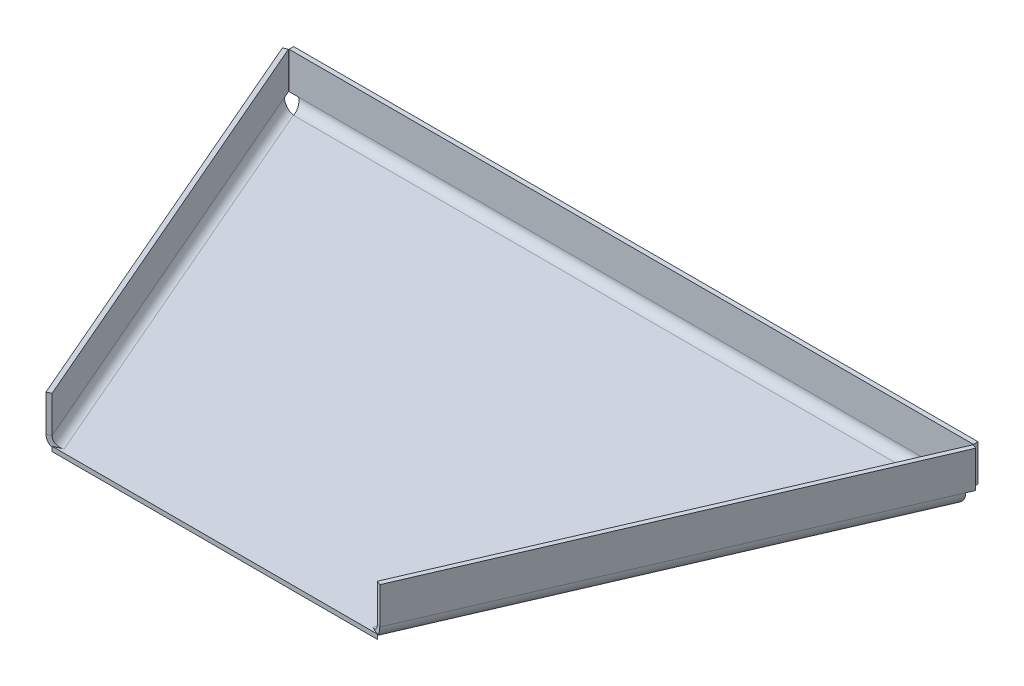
ISO-10303-21;
HEADER;
FILE_DESCRIPTION(('STEP AP214'),'2;1');
FILE_NAME('part.step','',(''),(''),'','','');
FILE_SCHEMA(('AUTOMOTIVE_DESIGN { 1 0 10303 214 1 1 1 1 }'));
ENDSEC;
DATA;
#1=APPLICATION_CONTEXT('core data for automotive mechanical design processes');
#2=APPLICATION_PROTOCOL_DEFINITION('international standard','automotive_design',2000,#1);
#3=PRODUCT_CONTEXT('',#1,'mechanical');
#4=PRODUCT('Part','Part','',(#3));
#5=PRODUCT_RELATED_PRODUCT_CATEGORY('part','',(#4));
#6=PRODUCT_DEFINITION_FORMATION('','',#4);
#7=PRODUCT_DEFINITION_CONTEXT('part definition',#1,'design');
#8=PRODUCT_DEFINITION('design','',#6,#7);
#9=PRODUCT_DEFINITION_SHAPE('','',#8);
#10=(LENGTH_UNIT() NAMED_UNIT(*) SI_UNIT(.MILLI.,.METRE.));
#11=(NAMED_UNIT(*) PLANE_ANGLE_UNIT() SI_UNIT($,.RADIAN.));
#12=(NAMED_UNIT(*) SI_UNIT($,.STERADIAN.) SOLID_ANGLE_UNIT());
#13=UNCERTAINTY_MEASURE_WITH_UNIT(LENGTH_MEASURE(1.E-05),#10,'distance_accuracy_value','');
#14=(GEOMETRIC_REPRESENTATION_CONTEXT(3) GLOBAL_UNCERTAINTY_ASSIGNED_CONTEXT((#13)) GLOBAL_UNIT_ASSIGNED_CONTEXT((#10,
#11,#12)) REPRESENTATION_CONTEXT('',''));
#15=CARTESIAN_POINT('',(0.,0.,0.));
#16=DIRECTION('',(0.,0.,1.));
#17=DIRECTION('',(1.,0.,0.));
#18=AXIS2_PLACEMENT_3D('',#15,#16,#17);
#19=CARTESIAN_POINT('',(27.5041105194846,-1.07450097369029E-12,63.6738996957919));
#20=DIRECTION('',(-0.396540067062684,0.,-0.918017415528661));
#21=DIRECTION('',(-0.918017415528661,0.,0.396540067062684));
#22=AXIS2_PLACEMENT_3D('',#19,#20,#21);
#23=PLANE('',#22);
#24=CARTESIAN_POINT('',(-33.6579415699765,1.99999999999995,90.0930109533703));
#25=DIRECTION('',(-0.396540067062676,0.,-0.918017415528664));
#26=DIRECTION('',(0.918017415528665,0.,-0.396540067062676));
#27=AXIS2_PLACEMENT_3D('',#24,#25,#26);
#28=CIRCLE('',#27,3.);
#29=CARTESIAN_POINT('',(-33.6579415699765,-1.00000000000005,90.0930109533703));
#30=VERTEX_POINT('',#29);
#31=CARTESIAN_POINT('',(-35.4939764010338,-0.23606797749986,90.8860910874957));
#32=VERTEX_POINT('',#31);
#33=EDGE_CURVE('E654',#30,#32,#28,.T.);
#34=ORIENTED_EDGE('',*,*,#33,.F.);
#35=DIRECTION('',(0.918017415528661,0.,-0.396540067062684));
#36=VECTOR('',#35,1.);
#37=CARTESIAN_POINT('',(-35.4939764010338,-1.00000000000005,90.8860910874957));
#38=LINE('',#37,#36);
#39=CARTESIAN_POINT('',(-35.4939764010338,-1.00000000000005,90.8860910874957));
#40=VERTEX_POINT('',#39);
#41=EDGE_CURVE('E886',#40,#30,#38,.T.);
#42=ORIENTED_EDGE('',*,*,#41,.F.);
#43=DIRECTION('',(0.,1.,0.));
#44=VECTOR('',#43,1.);
#45=CARTESIAN_POINT('',(-35.4939764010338,-1.00000000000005,90.8860910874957));
#46=LINE('',#45,#44);
#47=EDGE_CURVE('E889',#40,#32,#46,.T.);
#48=ORIENTED_EDGE('',*,*,#47,.T.);
#49=EDGE_LOOP('',(#34,#42,#48));
#50=FACE_BOUND('',#49,.T.);
#51=ADVANCED_FACE('F84',(#50),#23,.T.);
#52=CARTESIAN_POINT('',(0.,-1.00000000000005,0.));
#53=DIRECTION('',(0.,-1.,0.));
#54=DIRECTION('',(0.,0.,-1.));
#55=AXIS2_PLACEMENT_3D('',#52,#53,#54);
#56=PLANE('',#55);
#57=DIRECTION('',(-0.396540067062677,0.,-0.918017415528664));
#58=VECTOR('',#57,1.);
#59=CARTESIAN_POINT('',(-33.6579415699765,-1.00000000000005,90.0930109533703));
#60=LINE('',#59,#58);
#61=CARTESIAN_POINT('',(-71.7099522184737,-0.999999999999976,2.00000000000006));
#62=VERTEX_POINT('',#61);
#63=EDGE_CURVE('E892',#30,#62,#60,.T.);
#64=ORIENTED_EDGE('',*,*,#63,.T.);
#65=DIRECTION('',(1.,0.,0.));
#66=VECTOR('',#65,1.);
#67=CARTESIAN_POINT('',(-72.5738575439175,-1.00000000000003,1.99999999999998));
#68=LINE('',#67,#66);
#69=CARTESIAN_POINT('',(71.7099522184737,-0.999999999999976,2.00000000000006));
#70=VERTEX_POINT('',#69);
#71=EDGE_CURVE('E899',#62,#70,#68,.T.);
#72=ORIENTED_EDGE('',*,*,#71,.T.);
#73=DIRECTION('',(0.396540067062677,0.,-0.918017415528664));
#74=VECTOR('',#73,1.);
#75=CARTESIAN_POINT('',(33.6579415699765,-1.00000000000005,90.0930109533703));
#76=LINE('',#75,#74);
#77=CARTESIAN_POINT('',(33.6579415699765,-1.00000000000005,90.0930109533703));
#78=VERTEX_POINT('',#77);
#79=EDGE_CURVE('E383',#78,#70,#76,.T.);
#80=ORIENTED_EDGE('',*,*,#79,.F.);
#81=DIRECTION('',(-0.918017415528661,0.,-0.396540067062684));
#82=VECTOR('',#81,1.);
#83=CARTESIAN_POINT('',(35.4939764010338,-1.00000000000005,90.8860910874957));
#84=LINE('',#83,#82);
#85=CARTESIAN_POINT('',(35.4939764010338,-1.00000000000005,90.8860910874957));
#86=VERTEX_POINT('',#85);
#87=EDGE_CURVE('E498',#86,#78,#84,.T.);
#88=ORIENTED_EDGE('',*,*,#87,.F.);
#89=DIRECTION('',(1.,0.,0.));
#90=VECTOR('',#89,1.);
#91=CARTESIAN_POINT('',(0.,-1.00000000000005,90.8860910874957));
#92=LINE('',#91,#90);
#93=EDGE_CURVE('E893',#40,#86,#92,.T.);
#94=ORIENTED_EDGE('',*,*,#93,.F.);
#95=ORIENTED_EDGE('',*,*,#41,.T.);
#96=EDGE_LOOP('',(#64,#72,#80,#88,#94,#95));
#97=FACE_BOUND('',#96,.T.);
#98=ADVANCED_FACE('F868',(#97),#56,.T.);
#99=CARTESIAN_POINT('',(0.,0.,0.));
#100=DIRECTION('',(0.,-1.,0.));
#101=DIRECTION('',(0.,0.,-1.));
#102=AXIS2_PLACEMENT_3D('',#99,#100,#101);
#103=PLANE('',#102);
#104=DIRECTION('',(1.,0.,0.));
#105=VECTOR('',#104,1.);
#106=CARTESIAN_POINT('',(-72.5738575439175,0.,1.99999999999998));
#107=LINE('',#106,#105);
#108=CARTESIAN_POINT('',(-71.7099522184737,0.,2.00000000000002));
#109=VERTEX_POINT('',#108);
#110=CARTESIAN_POINT('',(71.7099522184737,0.,2.00000000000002));
#111=VERTEX_POINT('',#110);
#112=EDGE_CURVE('E110',#109,#111,#107,.T.);
#113=ORIENTED_EDGE('',*,*,#112,.F.);
#114=DIRECTION('',(-0.396540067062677,0.,-0.918017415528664));
#115=VECTOR('',#114,1.);
#116=CARTESIAN_POINT('',(-33.6579415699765,0.,90.0930109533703));
#117=LINE('',#116,#115);
#118=CARTESIAN_POINT('',(-33.6579415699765,0.,90.0930109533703));
#119=VERTEX_POINT('',#118);
#120=EDGE_CURVE('E94',#119,#109,#117,.T.);
#121=ORIENTED_EDGE('',*,*,#120,.F.);
#122=DIRECTION('',(0.918017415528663,0.,-0.396540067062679));
#123=VECTOR('',#122,1.);
#124=CARTESIAN_POINT('',(-37.2629875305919,0.,91.650220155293));
#125=LINE('',#124,#123);
#126=CARTESIAN_POINT('',(-35.4939764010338,0.,90.8860910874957));
#127=VERTEX_POINT('',#126);
#128=EDGE_CURVE('E921',#127,#119,#125,.T.);
#129=ORIENTED_EDGE('',*,*,#128,.F.);
#130=DIRECTION('',(1.,0.,0.));
#131=VECTOR('',#130,1.);
#132=CARTESIAN_POINT('',(0.,0.,90.8860910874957));
#133=LINE('',#132,#131);
#134=CARTESIAN_POINT('',(35.4939764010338,0.,90.8860910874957));
#135=VERTEX_POINT('',#134);
#136=EDGE_CURVE('E894',#127,#135,#133,.T.);
#137=ORIENTED_EDGE('',*,*,#136,.T.);
#138=DIRECTION('',(-0.918017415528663,0.,-0.396540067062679));
#139=VECTOR('',#138,1.);
#140=CARTESIAN_POINT('',(37.2629875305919,0.,91.650220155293));
#141=LINE('',#140,#139);
#142=CARTESIAN_POINT('',(33.6579415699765,0.,90.0930109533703));
#143=VERTEX_POINT('',#142);
#144=EDGE_CURVE('E468',#135,#143,#141,.T.);
#145=ORIENTED_EDGE('',*,*,#144,.T.);
#146=DIRECTION('',(0.396540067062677,0.,-0.918017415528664));
#147=VECTOR('',#146,1.);
#148=CARTESIAN_POINT('',(33.6579415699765,0.,90.0930109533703));
#149=LINE('',#148,#147);
#150=EDGE_CURVE('E455',#143,#111,#149,.T.);
#151=ORIENTED_EDGE('',*,*,#150,.T.);
#152=EDGE_LOOP('',(#113,#121,#129,#137,#145,#151));
#153=FACE_BOUND('',#152,.T.);
#154=ADVANCED_FACE('F467',(#153),#103,.F.);
#155=CARTESIAN_POINT('',(0.,-1.00000000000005,90.8860910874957));
#156=DIRECTION('',(0.,0.,1.));
#157=DIRECTION('',(1.,0.,0.));
#158=AXIS2_PLACEMENT_3D('',#155,#156,#157);
#159=PLANE('',#158);
#160=ORIENTED_EDGE('',*,*,#136,.F.);
#161=EDGE_CURVE('E734',#32,#127,#46,.T.);
#162=ORIENTED_EDGE('',*,*,#161,.F.);
#163=ORIENTED_EDGE('',*,*,#47,.F.);
#164=ORIENTED_EDGE('',*,*,#93,.T.);
#165=DIRECTION('',(0.,1.,0.));
#166=VECTOR('',#165,1.);
#167=CARTESIAN_POINT('',(35.4939764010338,-1.00000000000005,90.8860910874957));
#168=LINE('',#167,#166);
#169=CARTESIAN_POINT('',(35.4939764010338,-0.23606797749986,90.8860910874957));
#170=VERTEX_POINT('',#169);
#171=EDGE_CURVE('E497',#86,#170,#168,.T.);
#172=ORIENTED_EDGE('',*,*,#171,.T.);
#173=EDGE_CURVE('E494',#170,#135,#168,.T.);
#174=ORIENTED_EDGE('',*,*,#173,.T.);
#175=EDGE_LOOP('',(#160,#162,#163,#164,#172,#174));
#176=FACE_BOUND('',#175,.T.);
#177=ADVANCED_FACE('F873',(#176),#159,.T.);
#178=CARTESIAN_POINT('',(0.,9.99999999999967,-1.00000000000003));
#179=DIRECTION('',(0.,-1.,0.));
#180=DIRECTION('',(0.,0.,-1.));
#181=AXIS2_PLACEMENT_3D('',#178,#179,#180);
#182=PLANE('',#181);
#183=DIRECTION('',(1.,0.,0.));
#184=VECTOR('',#183,1.);
#185=CARTESIAN_POINT('',(0.,9.99999999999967,0.));
#186=LINE('',#185,#184);
#187=CARTESIAN_POINT('',(-74.6614404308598,9.99999999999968,0.));
#188=VERTEX_POINT('',#187);
#189=CARTESIAN_POINT('',(74.6614404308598,9.99999999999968,0.));
#190=VERTEX_POINT('',#189);
#191=EDGE_CURVE('E836',#188,#190,#186,.T.);
#192=ORIENTED_EDGE('',*,*,#191,.T.);
#193=DIRECTION('',(0.,0.,1.));
#194=VECTOR('',#193,1.);
#195=CARTESIAN_POINT('',(74.6614404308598,9.99999999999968,-1.00000000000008));
#196=LINE('',#195,#194);
#197=CARTESIAN_POINT('',(74.6614404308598,9.99999999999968,-1.00000000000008));
#198=VERTEX_POINT('',#197);
#199=EDGE_CURVE('E1276',#198,#190,#196,.T.);
#200=ORIENTED_EDGE('',*,*,#199,.F.);
#201=DIRECTION('',(1.,0.,0.));
#202=VECTOR('',#201,1.);
#203=CARTESIAN_POINT('',(0.,9.99999999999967,-1.00000000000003));
#204=LINE('',#203,#202);
#205=CARTESIAN_POINT('',(-74.6614404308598,9.99999999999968,-1.00000000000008));
#206=VERTEX_POINT('',#205);
#207=EDGE_CURVE('E815',#206,#198,#204,.T.);
#208=ORIENTED_EDGE('',*,*,#207,.F.);
#209=DIRECTION('',(0.,0.,1.));
#210=VECTOR('',#209,1.);
#211=CARTESIAN_POINT('',(-74.6614404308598,9.99999999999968,-1.00000000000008));
#212=LINE('',#211,#210);
#213=EDGE_CURVE('E833',#206,#188,#212,.T.);
#214=ORIENTED_EDGE('',*,*,#213,.T.);
#215=EDGE_LOOP('',(#192,#200,#208,#214));
#216=FACE_BOUND('',#215,.T.);
#217=ADVANCED_FACE('F795',(#216),#182,.F.);
#218=CARTESIAN_POINT('',(-74.6614404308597,1.99999999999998,-1.00000000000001));
#219=DIRECTION('',(1.,0.,0.));
#220=DIRECTION('',(0.,1.,0.));
#221=AXIS2_PLACEMENT_3D('',#218,#219,#220);
#222=PLANE('',#221);
#223=DIRECTION('',(0.,1.,0.));
#224=VECTOR('',#223,1.);
#225=CARTESIAN_POINT('',(-74.6614404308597,1.99999999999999,0.));
#226=LINE('',#225,#224);
#227=CARTESIAN_POINT('',(-74.6614404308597,1.99999999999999,0.));
#228=VERTEX_POINT('',#227);
#229=EDGE_CURVE('E830',#228,#188,#226,.T.);
#230=ORIENTED_EDGE('',*,*,#229,.T.);
#231=ORIENTED_EDGE('',*,*,#213,.F.);
#232=DIRECTION('',(0.,1.,0.));
#233=VECTOR('',#232,1.);
#234=CARTESIAN_POINT('',(-74.6614404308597,1.99999999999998,-1.00000000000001));
#235=LINE('',#234,#233);
#236=CARTESIAN_POINT('',(-74.6614404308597,1.99999999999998,-1.00000000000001));
#237=VERTEX_POINT('',#236);
#238=EDGE_CURVE('E823',#237,#206,#235,.T.);
#239=ORIENTED_EDGE('',*,*,#238,.F.);
#240=DIRECTION('',(0.,0.,1.));
#241=VECTOR('',#240,1.);
#242=CARTESIAN_POINT('',(-74.6614404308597,1.99999999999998,-1.00000000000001));
#243=LINE('',#242,#241);
#244=EDGE_CURVE('E827',#237,#228,#243,.T.);
#245=ORIENTED_EDGE('',*,*,#244,.T.);
#246=EDGE_LOOP('',(#230,#231,#239,#245));
#247=FACE_BOUND('',#246,.T.);
#248=ADVANCED_FACE('F879',(#247),#222,.F.);
#249=CARTESIAN_POINT('',(0.,0.,-1.));
#250=DIRECTION('',(0.,0.,1.));
#251=DIRECTION('',(0.,-1.,0.));
#252=AXIS2_PLACEMENT_3D('',#249,#250,#251);
#253=PLANE('',#252);
#254=DIRECTION('',(1.,0.,0.));
#255=VECTOR('',#254,1.);
#256=CARTESIAN_POINT('',(0.,2.,-1.00000000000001));
#257=LINE('',#256,#255);
#258=CARTESIAN_POINT('',(-72.5738575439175,1.99999999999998,-1.00000000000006));
#259=VERTEX_POINT('',#258);
#260=CARTESIAN_POINT('',(72.5738575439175,1.99999999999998,-1.00000000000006));
#261=VERTEX_POINT('',#260);
#262=EDGE_CURVE('E838',#259,#261,#257,.T.);
#263=ORIENTED_EDGE('',*,*,#262,.F.);
#264=DIRECTION('',(-1.,0.,0.));
#265=VECTOR('',#264,1.);
#266=CARTESIAN_POINT('',(-72.5738575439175,1.99999999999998,-1.00000000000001));
#267=LINE('',#266,#265);
#268=EDGE_CURVE('E826',#259,#237,#267,.T.);
#269=ORIENTED_EDGE('',*,*,#268,.T.);
#270=ORIENTED_EDGE('',*,*,#238,.T.);
#271=ORIENTED_EDGE('',*,*,#207,.T.);
#272=DIRECTION('',(0.,1.,0.));
#273=VECTOR('',#272,1.);
#274=CARTESIAN_POINT('',(74.6614404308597,1.99999999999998,-1.00000000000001));
#275=LINE('',#274,#273);
#276=CARTESIAN_POINT('',(74.6614404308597,1.99999999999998,-1.00000000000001));
#277=VERTEX_POINT('',#276);
#278=EDGE_CURVE('E517',#277,#198,#275,.T.);
#279=ORIENTED_EDGE('',*,*,#278,.F.);
#280=DIRECTION('',(1.,0.,0.));
#281=VECTOR('',#280,1.);
#282=CARTESIAN_POINT('',(72.5738575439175,1.99999999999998,-1.00000000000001));
#283=LINE('',#282,#281);
#284=EDGE_CURVE('E522',#261,#277,#283,.T.);
#285=ORIENTED_EDGE('',*,*,#284,.F.);
#286=EDGE_LOOP('',(#263,#269,#270,#271,#279,#285));
#287=FACE_BOUND('',#286,.T.);
#288=ADVANCED_FACE('F865',(#287),#253,.F.);
#289=CARTESIAN_POINT('',(-72.5738575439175,1.99999999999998,-1.00000000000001));
#290=DIRECTION('',(0.,1.,0.));
#291=DIRECTION('',(0.,0.,1.));
#292=AXIS2_PLACEMENT_3D('',#289,#290,#291);
#293=PLANE('',#292);
#294=DIRECTION('',(-1.,0.,0.));
#295=VECTOR('',#294,1.);
#296=CARTESIAN_POINT('',(-72.5738575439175,1.99999999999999,0.));
#297=LINE('',#296,#295);
#298=CARTESIAN_POINT('',(-72.5738575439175,1.99999999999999,0.));
#299=VERTEX_POINT('',#298);
#300=EDGE_CURVE('E822',#299,#228,#297,.T.);
#301=ORIENTED_EDGE('',*,*,#300,.T.);
#302=ORIENTED_EDGE('',*,*,#244,.F.);
#303=ORIENTED_EDGE('',*,*,#268,.F.);
#304=CARTESIAN_POINT('',(-72.5738575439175,2.,0.00999999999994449));
#305=CARTESIAN_POINT('',(-72.5738575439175,2.,0.));
#306=CARTESIAN_POINT('',(-72.5738575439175,1.99999999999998,-1.00000000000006));
#307=CARTESIAN_POINT('',(-72.5738575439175,1.99999999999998,-1.01010000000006));
#308=B_SPLINE_CURVE_WITH_KNOTS('',1,(#304,#305,#306,#307),.UNSPECIFIED.,.F.,.F.,(2,1,1,2),
(-0.0101,-9.9999999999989E-05,0.9999,1.01),.UNSPECIFIED.);
#309=EDGE_CURVE('E772',#299,#259,#308,.T.);
#310=ORIENTED_EDGE('',*,*,#309,.F.);
#311=EDGE_LOOP('',(#301,#302,#303,#310));
#312=FACE_BOUND('',#311,.T.);
#313=ADVANCED_FACE('F855',(#312),#293,.F.);
#314=CARTESIAN_POINT('',(0.,0.,0.));
#315=DIRECTION('',(0.,0.,1.));
#316=DIRECTION('',(0.,-1.,0.));
#317=AXIS2_PLACEMENT_3D('',#314,#315,#316);
#318=PLANE('',#317);
#319=ORIENTED_EDGE('',*,*,#191,.F.);
#320=ORIENTED_EDGE('',*,*,#229,.F.);
#321=ORIENTED_EDGE('',*,*,#300,.F.);
#322=DIRECTION('',(-1.,0.,0.));
#323=VECTOR('',#322,1.);
#324=CARTESIAN_POINT('',(0.,1.99999999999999,0.));
#325=LINE('',#324,#323);
#326=CARTESIAN_POINT('',(72.5738575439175,1.99999999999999,0.));
#327=VERTEX_POINT('',#326);
#328=EDGE_CURVE('E840',#327,#299,#325,.T.);
#329=ORIENTED_EDGE('',*,*,#328,.F.);
#330=DIRECTION('',(1.,0.,0.));
#331=VECTOR('',#330,1.);
#332=CARTESIAN_POINT('',(72.5738575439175,1.99999999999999,0.));
#333=LINE('',#332,#331);
#334=CARTESIAN_POINT('',(74.6614404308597,1.99999999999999,0.));
#335=VERTEX_POINT('',#334);
#336=EDGE_CURVE('E509',#327,#335,#333,.T.);
#337=ORIENTED_EDGE('',*,*,#336,.T.);
#338=DIRECTION('',(0.,1.,0.));
#339=VECTOR('',#338,1.);
#340=CARTESIAN_POINT('',(74.6614404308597,1.99999999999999,0.));
#341=LINE('',#340,#339);
#342=EDGE_CURVE('E1349',#335,#190,#341,.T.);
#343=ORIENTED_EDGE('',*,*,#342,.T.);
#344=EDGE_LOOP('',(#319,#320,#321,#329,#337,#343));
#345=FACE_BOUND('',#344,.T.);
#346=ADVANCED_FACE('F793',(#345),#318,.T.);
#347=CARTESIAN_POINT('',(-71.7099522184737,-1.01009999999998,2.00000000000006));
#348=CARTESIAN_POINT('',(-71.7819568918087,-1.01009999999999,1.60591008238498));
#349=CARTESIAN_POINT('',(-71.853936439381,-0.9317551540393,1.21211269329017));
#350=CARTESIAN_POINT('',(-71.9979206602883,-0.630184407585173,0.484056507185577));
#351=CARTESIAN_POINT('',(-72.069912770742,-0.407077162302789,0.150152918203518));
#352=CARTESIAN_POINT('',(-72.2138969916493,0.150152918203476,-0.407077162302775));
#353=CARTESIAN_POINT('',(-72.2858891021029,0.484056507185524,-0.630184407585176));
#354=CARTESIAN_POINT('',(-72.4298733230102,1.2121126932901,-0.93175515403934));
#355=CARTESIAN_POINT('',(-72.5018528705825,1.60591008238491,-1.01010000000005));
#356=CARTESIAN_POINT('',(-72.5738575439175,1.99999999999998,-1.01010000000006));
#357=CARTESIAN_POINT('',(-71.7099522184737,-0.999999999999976,2.00000000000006));
#358=CARTESIAN_POINT('',(-71.7819568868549,-0.999999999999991,1.60723241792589));
#359=CARTESIAN_POINT('',(-71.853936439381,-0.92191803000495,1.2147563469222));
#360=CARTESIAN_POINT('',(-71.9979206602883,-0.621359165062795,0.489143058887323));
#361=CARTESIAN_POINT('',(-72.069912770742,-0.399000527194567,0.156359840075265));
#362=CARTESIAN_POINT('',(-72.2138969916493,0.156359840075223,-0.399000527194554));
#363=CARTESIAN_POINT('',(-72.2858891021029,0.489143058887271,-0.621359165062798));
#364=CARTESIAN_POINT('',(-72.4298733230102,1.21475634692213,-0.92191803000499));
#365=CARTESIAN_POINT('',(-72.5018528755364,1.60723241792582,-1.00000000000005));
#366=CARTESIAN_POINT('',(-72.5738575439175,1.99999999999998,-1.00000000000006));
#367=CARTESIAN_POINT('',(-71.7099522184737,0.,2.00000000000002));
#368=CARTESIAN_POINT('',(-71.781956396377,0.,1.73815672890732));
#369=CARTESIAN_POINT('',(-71.853936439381,0.0520546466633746,1.47650423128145));
#370=CARTESIAN_POINT('',(-71.9979206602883,0.252427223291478,0.992762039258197));
#371=CARTESIAN_POINT('',(-72.069912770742,0.40066631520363,0.770906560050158));
#372=CARTESIAN_POINT('',(-72.2138969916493,0.770906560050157,0.400666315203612));
#373=CARTESIAN_POINT('',(-72.2858891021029,0.992762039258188,0.252427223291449));
#374=CARTESIAN_POINT('',(-72.4298733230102,1.47650423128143,0.0520546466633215));
#375=CARTESIAN_POINT('',(-72.5018533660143,1.7381567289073,0.));
#376=CARTESIAN_POINT('',(-72.5738575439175,2.,0.));
#377=CARTESIAN_POINT('',(-71.7099522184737,0.0100000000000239,2.00000000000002));
#378=CARTESIAN_POINT('',(-71.7819563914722,0.0100000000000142,1.73946597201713));
#379=CARTESIAN_POINT('',(-71.853936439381,0.0617943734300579,1.47912171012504));
#380=CARTESIAN_POINT('',(-71.9979206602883,0.261165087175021,0.997798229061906));
#381=CARTESIAN_POINT('',(-72.069912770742,0.408662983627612,0.777052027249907));
#382=CARTESIAN_POINT('',(-72.2138969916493,0.777052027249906,0.408662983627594));
#383=CARTESIAN_POINT('',(-72.2858891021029,0.997798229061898,0.261165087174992));
#384=CARTESIAN_POINT('',(-72.4298733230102,1.47912171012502,0.0617943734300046));
#385=CARTESIAN_POINT('',(-72.5018533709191,1.73946597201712,0.00999999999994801));
#386=CARTESIAN_POINT('',(-72.5738575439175,2.,0.00999999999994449));
#387=B_SPLINE_SURFACE_WITH_KNOTS('',1,3,((#347,#348,#349,#350,#351,#352,#353,#354,#355,#356),
(#357,#358,#359,#360,#361,#362,#363,#364,#365,#366),(#367,#368,#369,#370,#371,#372,#373,#374,
#375,#376),(#377,#378,#379,#380,#381,#382,#383,#384,#385,#386)),.UNSPECIFIED.,.F.,.F.,.F.,(2,1,
1,2),(4,2,2,2,4),(-0.0101,0.,1.,1.01),(0.,0.25,0.5,0.75,1.),.UNSPECIFIED.);
#388=CARTESIAN_POINT('',(-71.7099522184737,0.,2.00000000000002));
#389=CARTESIAN_POINT('',(-71.7260033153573,2.66103304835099E-08,1.94163458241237));
#390=CARTESIAN_POINT('',(-71.7420459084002,0.00255654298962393,1.88329692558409));
#391=CARTESIAN_POINT('',(-71.7741295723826,0.0127531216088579,1.76707050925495));
#392=CARTESIAN_POINT('',(-71.790170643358,0.020392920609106,1.709181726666));
#393=CARTESIAN_POINT('',(-71.8382635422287,0.050859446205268,1.53696206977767));
#394=CARTESIAN_POINT('',(-71.8703386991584,0.0812335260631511,1.42387982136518));
#395=CARTESIAN_POINT('',(-71.9344956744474,0.16120790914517,1.20471445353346));
#396=CARTESIAN_POINT('',(-71.966577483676,0.210820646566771,1.09863591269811));
#397=CARTESIAN_POINT('',(-72.0307343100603,0.327749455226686,0.896743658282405));
#398=CARTESIAN_POINT('',(-72.0628093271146,0.395061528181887,0.800927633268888));
#399=CARTESIAN_POINT('',(-72.1269611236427,0.545330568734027,0.6224855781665));
#400=CARTESIAN_POINT('',(-72.1590379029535,0.628286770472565,0.539858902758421));
#401=CARTESIAN_POINT('',(-72.2231985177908,0.807350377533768,0.39028065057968));
#402=CARTESIAN_POINT('',(-72.2552823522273,0.903462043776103,0.323334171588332));
#403=CARTESIAN_POINT('',(-72.3194609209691,1.10589214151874,0.207180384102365));
#404=CARTESIAN_POINT('',(-72.3515556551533,1.21221413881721,0.157979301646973));
#405=CARTESIAN_POINT('',(-72.4157263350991,1.43175258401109,0.078887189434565));
#406=CARTESIAN_POINT('',(-72.4478022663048,1.5449618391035,0.048976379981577));
#407=CARTESIAN_POINT('',(-72.4955334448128,1.7160087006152,0.019440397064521));
#408=CARTESIAN_POINT('',(-72.5112127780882,1.77261241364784,0.0121494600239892));
#409=CARTESIAN_POINT('',(-72.542544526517,1.88613559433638,0.00243373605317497));
#410=CARTESIAN_POINT('',(-72.5581969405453,1.94305433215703,4.18833425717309E-07));
#411=CARTESIAN_POINT('',(-72.5738575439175,2.,0.));
#412=B_SPLINE_CURVE_WITH_KNOTS('',3,(#388,#389,#390,#391,#392,#393,#394,#395,#396,#397,#398,
#399,#400,#401,#402,#403,#404,#405,#406,#407,#408,#409,#410,#411),.UNSPECIFIED.,.F.,.F.,(4,2,2,
2,2,2,2,2,2,2,2,4),(0.,0.181485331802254,0.362961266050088,0.725305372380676,1.08788405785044,
1.45038090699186,1.81286001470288,2.17545680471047,2.53818068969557,2.90053205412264,
3.07791732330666,3.2549908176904),.UNSPECIFIED.);
#413=EDGE_CURVE('E683',#109,#299,#412,.T.);
#414=CARTESIAN_POINT('',(-71.7099522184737,-0.999999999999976,2.00000000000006));
#415=CARTESIAN_POINT('',(-71.725555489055,-1.00000837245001,1.91489168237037));
#416=CARTESIAN_POINT('',(-71.7411579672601,-0.996378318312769,1.82978721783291));
#417=CARTESIAN_POINT('',(-71.7723614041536,-0.981906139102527,1.66019812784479));
#418=CARTESIAN_POINT('',(-71.7879623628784,-0.971064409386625,1.57571346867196));
#419=CARTESIAN_POINT('',(-71.8191537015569,-0.94224365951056,1.40802490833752));
#420=CARTESIAN_POINT('',(-71.8347440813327,-0.924269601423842,1.32482015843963));
#421=CARTESIAN_POINT('',(-71.865921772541,-0.881332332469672,1.1602586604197));
#422=CARTESIAN_POINT('',(-71.8815090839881,-0.856369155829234,1.0789019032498));
#423=CARTESIAN_POINT('',(-71.9285326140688,-0.770747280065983,0.83712173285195));
#424=CARTESIAN_POINT('',(-71.9599939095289,-0.69957827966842,0.680278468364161));
#425=CARTESIAN_POINT('',(-72.0228892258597,-0.531562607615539,0.381156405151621));
#426=CARTESIAN_POINT('',(-72.0543232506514,-0.434720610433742,0.238874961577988));
#427=CARTESIAN_POINT('',(-72.1171997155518,-0.218171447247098,-0.0270929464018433));
#428=CARTESIAN_POINT('',(-72.1486421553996,-0.0984649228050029,-0.150779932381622));
#429=CARTESIAN_POINT('',(-72.2115300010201,0.160334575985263,-0.375932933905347));
#430=CARTESIAN_POINT('',(-72.2429754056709,0.299432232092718,-0.477393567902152));
#431=CARTESIAN_POINT('',(-72.3058741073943,0.592923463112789,-0.655105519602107));
#432=CARTESIAN_POINT('',(-72.3373274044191,0.747320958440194,-0.731350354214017));
#433=CARTESIAN_POINT('',(-72.4002225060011,1.06681871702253,-0.856315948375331));
#434=CARTESIAN_POINT('',(-72.4316643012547,1.23191079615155,-0.905057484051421));
#435=CARTESIAN_POINT('',(-72.4815632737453,1.49859804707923,-0.959525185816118));
#436=CARTESIAN_POINT('',(-72.5000374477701,1.59835519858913,-0.974699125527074));
#437=CARTESIAN_POINT('',(-72.5369569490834,1.79872699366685,-0.994931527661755));
#438=CARTESIAN_POINT('',(-72.5554022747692,1.89933999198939,-1.00000628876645));
#439=CARTESIAN_POINT('',(-72.5738575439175,1.99999999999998,-1.00000000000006));
#440=B_SPLINE_CURVE_WITH_KNOTS('',3,(#414,#415,#416,#417,#418,#419,#420,#421,#422,#423,#424,
#425,#426,#427,#428,#429,#430,#431,#432,#433,#434,#435,#436,#437,#438,#439),.UNSPECIFIED.,.F.,
.F.,(4,2,2,2,2,2,2,2,2,2,2,2,4),(0.,0.259497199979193,0.518980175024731,0.778282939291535,
1.03758443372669,1.56012825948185,2.08257700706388,2.60501109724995,3.12757154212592,
3.6502662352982,4.1725655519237,4.47985512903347,4.78664837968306),.UNSPECIFIED.);
#441=EDGE_CURVE('E841',#62,#259,#440,.T.);
#442=CARTESIAN_POINT('',(-71.7099522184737,0.,2.));
#443=CARTESIAN_POINT('',(-71.7099522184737,-1.00000000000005,2.));
#444=B_SPLINE_CURVE_WITH_KNOTS('',1,(#442,#443),.UNSPECIFIED.,.F.,.F.,(2,2),(0.,1.),.UNSPECIFIED.);
#445=EDGE_CURVE('E12',#109,#62,#444,.T.);
#446=ORIENTED_EDGE('',*,*,#413,.T.);
#447=ORIENTED_EDGE('',*,*,#309,.T.);
#448=ORIENTED_EDGE('',*,*,#441,.F.);
#449=ORIENTED_EDGE('',*,*,#445,.F.);
#450=EDGE_LOOP('',(#446,#447,#448,#449));
#451=FACE_BOUND('',#450,.T.);
#452=ADVANCED_FACE('F780',(#451),#387,.T.);
#453=CARTESIAN_POINT('',(36.399975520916,2.,2.00000000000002));
#454=DIRECTION('',(-1.,0.,0.));
#455=DIRECTION('',(0.,0.,1.));
#456=AXIS2_PLACEMENT_3D('',#453,#454,#455);
#457=CYLINDRICAL_SURFACE('',#456,3.);
#458=ORIENTED_EDGE('',*,*,#71,.F.);
#459=ORIENTED_EDGE('',*,*,#441,.T.);
#460=ORIENTED_EDGE('',*,*,#262,.T.);
#461=CARTESIAN_POINT('',(71.7099522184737,-0.999999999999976,2.00000000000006));
#462=CARTESIAN_POINT('',(71.725555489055,-1.00000837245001,1.91489168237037));
#463=CARTESIAN_POINT('',(71.7411579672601,-0.996378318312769,1.82978721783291));
#464=CARTESIAN_POINT('',(71.7723614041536,-0.981906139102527,1.66019812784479));
#465=CARTESIAN_POINT('',(71.7879623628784,-0.971064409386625,1.57571346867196));
#466=CARTESIAN_POINT('',(71.8191537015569,-0.94224365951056,1.40802490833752));
#467=CARTESIAN_POINT('',(71.8347440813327,-0.924269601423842,1.32482015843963));
#468=CARTESIAN_POINT('',(71.865921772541,-0.881332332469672,1.1602586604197));
#469=CARTESIAN_POINT('',(71.8815090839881,-0.856369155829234,1.0789019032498));
#470=CARTESIAN_POINT('',(71.9285326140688,-0.770747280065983,0.83712173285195));
#471=CARTESIAN_POINT('',(71.9599939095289,-0.69957827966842,0.680278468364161));
#472=CARTESIAN_POINT('',(72.0228892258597,-0.531562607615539,0.381156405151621));
#473=CARTESIAN_POINT('',(72.0543232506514,-0.434720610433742,0.238874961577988));
#474=CARTESIAN_POINT('',(72.1171997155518,-0.218171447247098,-0.0270929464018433));
#475=CARTESIAN_POINT('',(72.1486421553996,-0.0984649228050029,-0.150779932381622));
#476=CARTESIAN_POINT('',(72.2115300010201,0.160334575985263,-0.375932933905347));
#477=CARTESIAN_POINT('',(72.2429754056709,0.299432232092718,-0.477393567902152));
#478=CARTESIAN_POINT('',(72.3058741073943,0.592923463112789,-0.655105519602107));
#479=CARTESIAN_POINT('',(72.3373274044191,0.747320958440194,-0.731350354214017));
#480=CARTESIAN_POINT('',(72.4002225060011,1.06681871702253,-0.856315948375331));
#481=CARTESIAN_POINT('',(72.4316643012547,1.23191079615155,-0.905057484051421));
#482=CARTESIAN_POINT('',(72.4815632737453,1.49859804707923,-0.959525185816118));
#483=CARTESIAN_POINT('',(72.5000374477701,1.59835519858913,-0.974699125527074));
#484=CARTESIAN_POINT('',(72.5369569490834,1.79872699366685,-0.994931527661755));
#485=CARTESIAN_POINT('',(72.5554022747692,1.89933999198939,-1.00000628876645));
#486=CARTESIAN_POINT('',(72.5738575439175,1.99999999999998,-1.00000000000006));
#487=B_SPLINE_CURVE_WITH_KNOTS('',3,(#461,#462,#463,#464,#465,#466,#467,#468,#469,#470,#471,
#472,#473,#474,#475,#476,#477,#478,#479,#480,#481,#482,#483,#484,#485,#486),.UNSPECIFIED.,.F.,
.F.,(4,2,2,2,2,2,2,2,2,2,2,2,4),(0.,0.259497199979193,0.518980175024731,0.778282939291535,
1.03758443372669,1.56012825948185,2.08257700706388,2.60501109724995,3.12757154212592,
3.6502662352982,4.1725655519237,4.47985512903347,4.78664837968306),.UNSPECIFIED.);
#488=EDGE_CURVE('E464',#70,#261,#487,.T.);
#489=ORIENTED_EDGE('',*,*,#488,.F.);
#490=EDGE_LOOP('',(#458,#459,#460,#489));
#491=FACE_BOUND('',#490,.T.);
#492=ADVANCED_FACE('F792',(#491),#457,.T.);
#493=CARTESIAN_POINT('',(36.399975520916,2.,2.00000000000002));
#494=DIRECTION('',(-1.,0.,0.));
#495=DIRECTION('',(0.,0.,1.));
#496=AXIS2_PLACEMENT_3D('',#493,#494,#495);
#497=CYLINDRICAL_SURFACE('',#496,2.);
#498=ORIENTED_EDGE('',*,*,#112,.T.);
#499=CARTESIAN_POINT('',(71.7099522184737,0.,2.00000000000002));
#500=CARTESIAN_POINT('',(71.7260033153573,2.66103304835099E-08,1.94163458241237));
#501=CARTESIAN_POINT('',(71.7420459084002,0.00255654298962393,1.88329692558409));
#502=CARTESIAN_POINT('',(71.7741295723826,0.0127531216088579,1.76707050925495));
#503=CARTESIAN_POINT('',(71.790170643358,0.020392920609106,1.709181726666));
#504=CARTESIAN_POINT('',(71.8382635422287,0.050859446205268,1.53696206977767));
#505=CARTESIAN_POINT('',(71.8703386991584,0.0812335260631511,1.42387982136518));
#506=CARTESIAN_POINT('',(71.9344956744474,0.16120790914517,1.20471445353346));
#507=CARTESIAN_POINT('',(71.966577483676,0.210820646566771,1.09863591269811));
#508=CARTESIAN_POINT('',(72.0307343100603,0.327749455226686,0.896743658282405));
#509=CARTESIAN_POINT('',(72.0628093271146,0.395061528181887,0.800927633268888));
#510=CARTESIAN_POINT('',(72.1269611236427,0.545330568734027,0.6224855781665));
#511=CARTESIAN_POINT('',(72.1590379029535,0.628286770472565,0.539858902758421));
#512=CARTESIAN_POINT('',(72.2231985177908,0.807350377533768,0.39028065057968));
#513=CARTESIAN_POINT('',(72.2552823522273,0.903462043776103,0.323334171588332));
#514=CARTESIAN_POINT('',(72.3194609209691,1.10589214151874,0.207180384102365));
#515=CARTESIAN_POINT('',(72.3515556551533,1.21221413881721,0.157979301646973));
#516=CARTESIAN_POINT('',(72.4157263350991,1.43175258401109,0.078887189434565));
#517=CARTESIAN_POINT('',(72.4478022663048,1.5449618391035,0.048976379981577));
#518=CARTESIAN_POINT('',(72.4955334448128,1.7160087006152,0.019440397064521));
#519=CARTESIAN_POINT('',(72.5112127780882,1.77261241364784,0.0121494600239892));
#520=CARTESIAN_POINT('',(72.542544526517,1.88613559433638,0.00243373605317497));
#521=CARTESIAN_POINT('',(72.5581969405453,1.94305433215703,4.18833425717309E-07));
#522=CARTESIAN_POINT('',(72.5738575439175,2.,0.));
#523=B_SPLINE_CURVE_WITH_KNOTS('',3,(#499,#500,#501,#502,#503,#504,#505,#506,#507,#508,#509,
#510,#511,#512,#513,#514,#515,#516,#517,#518,#519,#520,#521,#522),.UNSPECIFIED.,.F.,.F.,(4,2,2,
2,2,2,2,2,2,2,2,4),(0.,0.181485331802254,0.362961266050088,0.725305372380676,1.08788405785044,
1.45038090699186,1.81286001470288,2.17545680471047,2.53818068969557,2.90053205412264,
3.07791732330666,3.2549908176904),.UNSPECIFIED.);
#524=EDGE_CURVE('E394',#111,#327,#523,.T.);
#525=ORIENTED_EDGE('',*,*,#524,.T.);
#526=ORIENTED_EDGE('',*,*,#328,.T.);
#527=ORIENTED_EDGE('',*,*,#413,.F.);
#528=EDGE_LOOP('',(#498,#525,#526,#527));
#529=FACE_BOUND('',#528,.T.);
#530=ADVANCED_FACE('F746',(#529),#497,.F.);
#531=CARTESIAN_POINT('',(-55.6949289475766,2.,46.6413155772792));
#532=DIRECTION('',(0.,1.,0.));
#533=DIRECTION('',(-0.396540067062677,0.,-0.918017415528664));
#534=AXIS2_PLACEMENT_3D('',#531,#532,#533);
#535=PLANE('',#534);
#536=CARTESIAN_POINT('',(-74.977862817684,2.00000000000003,1.99999999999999));
#537=DIRECTION('',(1.,0.,0.));
#538=VECTOR('',#537,1.);
#539=LINE('',#536,#538);
#540=CARTESIAN_POINT('',(-74.9778640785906,1.99999999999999,1.99999999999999));
#541=VERTEX_POINT('',#540);
#542=CARTESIAN_POINT('',(-73.8885601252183,1.99999999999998,2.00000000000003));
#543=VERTEX_POINT('',#542);
#544=EDGE_CURVE('E101',#541,#543,#539,.T.);
#545=ORIENTED_EDGE('',*,*,#544,.T.);
#546=DIRECTION('',(-0.396540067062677,0.,-0.918017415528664));
#547=VECTOR('',#546,1.);
#548=CARTESIAN_POINT('',(-15.0976146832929,1.99999999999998,138.105065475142));
#549=LINE('',#548,#547);
#550=CARTESIAN_POINT('',(-74.059846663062,2.,1.60345993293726));
#551=VERTEX_POINT('',#550);
#552=EDGE_CURVE('E620',#543,#551,#549,.T.);
#553=ORIENTED_EDGE('',*,*,#552,.T.);
#554=CARTESIAN_POINT('',(-74.9778640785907,1.99999999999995,1.99999999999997));
#555=CARTESIAN_POINT('',(-74.059846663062,1.99999999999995,1.60345993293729));
#556=B_SPLINE_CURVE_WITH_KNOTS('',1,(#554,#555),.UNSPECIFIED.,.F.,.F.,(2,2),(0.,1.),.UNSPECIFIED.);
#557=EDGE_CURVE('E658',#551,#541,#556,.F.);
#558=ORIENTED_EDGE('',*,*,#557,.T.);
#559=EDGE_LOOP('',(#545,#553,#558));
#560=FACE_BOUND('',#559,.T.);
#561=ADVANCED_FACE('F678',(#560),#535,.T.);
#562=CARTESIAN_POINT('',(-74.9778640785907,1.99999999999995,1.99999999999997));
#563=CARTESIAN_POINT('',(-74.9751451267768,1.7631113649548,2.00629455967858));
#564=CARTESIAN_POINT('',(-74.9445809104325,1.5431263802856,2.0065395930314));
#565=CARTESIAN_POINT('',(-74.8724195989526,1.24406620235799,2.00452849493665));
#566=CARTESIAN_POINT('',(-74.8439685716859,1.14949351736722,2.0034556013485));
#567=CARTESIAN_POINT('',(-74.7964517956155,1.01551172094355,2.00200082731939));
#568=CARTESIAN_POINT('',(-74.7798045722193,0.972160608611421,2.00154097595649));
#569=CARTESIAN_POINT('',(-74.7538252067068,0.909096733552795,2.00097689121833));
#570=CARTESIAN_POINT('',(-74.7449972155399,0.888402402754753,2.0008097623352));
#571=CARTESIAN_POINT('',(-74.7315273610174,0.857849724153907,2.00060097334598));
#572=CARTESIAN_POINT('',(-74.7269994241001,0.847746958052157,2.0005383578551));
#573=CARTESIAN_POINT('',(-74.7178715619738,0.827703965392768,2.0004288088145));
#574=CARTESIAN_POINT('',(-74.7136682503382,0.818607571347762,2.00038514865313));
#575=CARTESIAN_POINT('',(-74.6281485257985,0.63665632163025,1.99967932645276));
#576=CARTESIAN_POINT('',(-74.5271547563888,0.466475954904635,1.9996756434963));
#577=CARTESIAN_POINT('',(-74.3429210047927,0.220149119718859,1.99980311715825));
#578=CARTESIAN_POINT('',(-74.2760673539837,0.139546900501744,1.99987416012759));
#579=CARTESIAN_POINT('',(-74.1675341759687,0.0219544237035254,1.99998506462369));
#580=CARTESIAN_POINT('',(-74.1299822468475,-0.0166904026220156,2.00002329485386));
#581=CARTESIAN_POINT('',(-74.0715939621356,-0.0736901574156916,2.0000829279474));
#582=CARTESIAN_POINT('',(-74.0517878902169,-0.0925287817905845,2.0001032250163));
#583=CARTESIAN_POINT('',(-74.0215647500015,-0.120527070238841,2.00013470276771));
#584=CARTESIAN_POINT('',(-74.0114047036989,-0.129816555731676,2.00014536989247));
#585=CARTESIAN_POINT('',(-73.9960363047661,-0.143683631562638,2.00016170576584));
#586=CARTESIAN_POINT('',(-73.9908921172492,-0.148294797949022,2.00016720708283));
#587=CARTESIAN_POINT('',(-73.9831437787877,-0.155194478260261,2.00017555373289));
#588=CARTESIAN_POINT('',(-73.9805556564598,-0.157491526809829,2.00017835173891));
#589=CARTESIAN_POINT('',(-73.9753687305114,-0.162079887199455,2.00018398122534));
#590=CARTESIAN_POINT('',(-73.9723111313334,-0.164774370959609,2.00018731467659));
#591=CARTESIAN_POINT('',(-73.832863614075,-0.28731549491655,2.00033988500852));
#592=CARTESIAN_POINT('',(-73.6766848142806,-0.403454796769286,2.00055726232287));
#593=CARTESIAN_POINT('',(-73.4130881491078,-0.562043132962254,2.00054626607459));
#594=CARTESIAN_POINT('',(-73.3203550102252,-0.612284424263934,2.00049527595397));
#595=CARTESIAN_POINT('',(-73.1740497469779,-0.682465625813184,2.00038919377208));
#596=CARTESIAN_POINT('',(-73.1240821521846,-0.704995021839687,2.00034965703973));
#597=CARTESIAN_POINT('',(-73.0473609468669,-0.737329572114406,2.00029659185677));
#598=CARTESIAN_POINT('',(-73.0214923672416,-0.747864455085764,2.00027999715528));
#599=CARTESIAN_POINT('',(-72.982252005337,-0.763281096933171,2.0002588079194));
#600=CARTESIAN_POINT('',(-72.969098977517,-0.768355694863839,2.00025236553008));
#601=CARTESIAN_POINT('',(-72.949260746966,-0.775868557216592,2.00024392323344));
#602=CARTESIAN_POINT('',(-72.9426298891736,-0.778356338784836,2.00024131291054));
#603=CARTESIAN_POINT('',(-72.9326565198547,-0.782062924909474,2.00023774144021));
#604=CARTESIAN_POINT('',(-72.9293275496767,-0.783294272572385,2.0002366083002));
#605=CARTESIAN_POINT('',(-72.9243273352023,-0.785134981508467,2.00023499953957));
#606=CARTESIAN_POINT('',(-72.9226594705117,-0.785747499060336,2.00023447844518));
#607=CARTESIAN_POINT('',(-72.9193214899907,-0.786970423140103,2.00023346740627));
#608=CARTESIAN_POINT('',(-72.9169886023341,-0.787822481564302,2.00023278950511));
#609=CARTESIAN_POINT('',(-72.7868961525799,-0.835255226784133,2.00019589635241));
#610=CARTESIAN_POINT('',(-72.6229888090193,-0.886648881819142,2.0006493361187));
#611=CARTESIAN_POINT('',(-72.2211191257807,-0.969054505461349,2.00063214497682));
#612=CARTESIAN_POINT('',(-71.983060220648,-1.00000000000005,2.00001546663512));
#613=CARTESIAN_POINT('',(-71.7099522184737,-1.00000000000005,2.));
#614=CARTESIAN_POINT('',(-74.059846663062,1.99999999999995,1.60345993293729));
#615=CARTESIAN_POINT('',(-74.0571277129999,1.84207434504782,1.60975448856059));
#616=CARTESIAN_POINT('',(-74.0351198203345,1.69541758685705,1.61369545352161));
#617=CARTESIAN_POINT('',(-73.9834740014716,1.49604413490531,1.62054607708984));
#618=CARTESIAN_POINT('',(-73.9631455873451,1.43299567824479,1.62298176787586));
#619=CARTESIAN_POINT('',(-73.9291536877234,1.34367448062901,1.62736910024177));
#620=CARTESIAN_POINT('',(-73.9172387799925,1.31477373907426,1.62895338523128));
#621=CARTESIAN_POINT('',(-73.8986259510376,1.27273115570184,1.63157129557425));
#622=CARTESIAN_POINT('',(-73.8922981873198,1.25893493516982,1.63248414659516));
#623=CARTESIAN_POINT('',(-73.8826376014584,1.23856648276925,1.63392078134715));
#624=CARTESIAN_POINT('',(-73.879389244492,1.23183130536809,1.63441088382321));
#625=CARTESIAN_POINT('',(-73.8728388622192,1.21846931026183,1.63541468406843));
#626=CARTESIAN_POINT('',(-73.8698216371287,1.21240504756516,1.63588335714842));
#627=CARTESIAN_POINT('',(-73.808411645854,1.09110421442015,1.64559179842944));
#628=CARTESIAN_POINT('',(-73.7357893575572,0.977650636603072,1.65784325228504));
#629=CARTESIAN_POINT('',(-73.6032948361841,0.813432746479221,1.68031962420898));
#630=CARTESIAN_POINT('',(-73.5552130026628,0.759697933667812,1.68849920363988));
#631=CARTESIAN_POINT('',(-73.4771553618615,0.681302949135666,1.70177409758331));
#632=CARTESIAN_POINT('',(-73.4501478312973,0.655539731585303,1.70636700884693));
#633=CARTESIAN_POINT('',(-73.4081546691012,0.617539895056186,1.71350855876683));
#634=CARTESIAN_POINT('',(-73.3939100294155,0.604980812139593,1.71593113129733));
#635=CARTESIAN_POINT('',(-73.3721733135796,0.586315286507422,1.7196283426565));
#636=CARTESIAN_POINT('',(-73.3648661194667,0.580122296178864,1.72087130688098));
#637=CARTESIAN_POINT('',(-73.3538130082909,0.570877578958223,1.72275164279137));
#638=CARTESIAN_POINT('',(-73.3501132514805,0.567803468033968,1.72338106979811));
#639=CARTESIAN_POINT('',(-73.3445405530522,0.563203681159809,1.72432918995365));
#640=CARTESIAN_POINT('',(-73.3426791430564,0.561672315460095,1.72464589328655));
#641=CARTESIAN_POINT('',(-73.3389486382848,0.558613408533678,1.72528062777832));
#642=CARTESIAN_POINT('',(-73.3367495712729,0.556817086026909,1.72565480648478));
#643=CARTESIAN_POINT('',(-73.236456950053,0.475123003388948,1.74272043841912));
#644=CARTESIAN_POINT('',(-73.1241253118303,0.397696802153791,1.7618777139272));
#645=CARTESIAN_POINT('',(-72.9345792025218,0.291971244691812,1.79385305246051));
#646=CARTESIAN_POINT('',(-72.8679027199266,0.258477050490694,1.80505730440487));
#647=CARTESIAN_POINT('',(-72.7627102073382,0.211689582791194,1.82270998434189));
#648=CARTESIAN_POINT('',(-72.7267842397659,0.196669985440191,1.82873576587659));
#649=CARTESIAN_POINT('',(-72.6716218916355,0.175113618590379,1.83799510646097));
#650=CARTESIAN_POINT('',(-72.6530222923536,0.168090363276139,1.84111836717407));
#651=CARTESIAN_POINT('',(-72.6248078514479,0.157812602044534,1.84585985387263));
#652=CARTESIAN_POINT('',(-72.6153505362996,0.154429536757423,1.84744978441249));
#653=CARTESIAN_POINT('',(-72.6010862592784,0.149420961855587,1.84984902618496));
#654=CARTESIAN_POINT('',(-72.596318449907,0.147762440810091,1.85065116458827));
#655=CARTESIAN_POINT('',(-72.5891472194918,0.145291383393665,1.85185798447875));
#656=CARTESIAN_POINT('',(-72.5867535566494,0.144470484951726,1.85226085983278));
#657=CARTESIAN_POINT('',(-72.5831581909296,0.143243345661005,1.85286607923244));
#658=CARTESIAN_POINT('',(-72.5819589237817,0.142835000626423,1.85306797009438));
#659=CARTESIAN_POINT('',(-72.5795587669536,0.142019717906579,1.85347205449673));
#660=CARTESIAN_POINT('',(-72.5778813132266,0.141451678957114,1.85375449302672));
#661=CARTESIAN_POINT('',(-72.4843387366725,0.10982984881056,1.86950541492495));
#662=CARTESIAN_POINT('',(-72.366421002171,0.0755674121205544,1.88982418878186));
#663=CARTESIAN_POINT('',(-72.0774460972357,0.0206303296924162,1.93857219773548));
#664=CARTESIAN_POINT('',(-71.9063086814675,0.,1.9668795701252));
#665=CARTESIAN_POINT('',(-71.7099522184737,0.,2.));
#666=B_SPLINE_SURFACE_WITH_KNOTS('',1,3,((#562,#563,#564,#565,#566,#567,#568,#569,#570,#571,
#572,#573,#574,#575,#576,#577,#578,#579,#580,#581,#582,#583,#584,#585,#586,#587,#588,#589,#590,
#591,#592,#593,#594,#595,#596,#597,#598,#599,#600,#601,#602,#603,#604,#605,#606,#607,#608,#609,
#610,#611,#612,#613),(#614,#615,#616,#617,#618,#619,#620,#621,#622,#623,#624,#625,#626,#627,
#628,#629,#630,#631,#632,#633,#634,#635,#636,#637,#638,#639,#640,#641,#642,#643,#644,#645,#646,
#647,#648,#649,#650,#651,#652,#653,#654,#655,#656,#657,#658,#659,#660,#661,#662,#663,#664,
#665)),.UNSPECIFIED.,.F.,.F.,.F.,(2,2),(4,2,2,2,2,2,2,2,2,2,2,2,2,2,2,2,2,2,2,2,2,2,2,2,2,4),
(0.,1.),(0.,0.125,0.1875,0.21875,0.234375,0.2421875,0.25,0.375,0.4375,0.46875,0.484375,
0.4921875,0.49609375,0.498046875,0.5,0.625,0.6875,0.71875,0.734375,0.7421875,0.74609375,
0.748046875,0.7490234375,0.75,0.875,1.),.UNSPECIFIED.);
#667=CARTESIAN_POINT('',(-74.059846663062,1.99999999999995,1.60345993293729));
#668=CARTESIAN_POINT('',(-74.0571277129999,1.84207434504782,1.60975448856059));
#669=CARTESIAN_POINT('',(-74.0351198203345,1.69541758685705,1.61369545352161));
#670=CARTESIAN_POINT('',(-73.9834740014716,1.49604413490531,1.62054607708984));
#671=CARTESIAN_POINT('',(-73.9631455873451,1.43299567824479,1.62298176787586));
#672=CARTESIAN_POINT('',(-73.9291536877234,1.34367448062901,1.62736910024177));
#673=CARTESIAN_POINT('',(-73.9172387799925,1.31477373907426,1.62895338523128));
#674=CARTESIAN_POINT('',(-73.8986259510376,1.27273115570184,1.63157129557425));
#675=CARTESIAN_POINT('',(-73.8922981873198,1.25893493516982,1.63248414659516));
#676=CARTESIAN_POINT('',(-73.8826376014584,1.23856648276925,1.63392078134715));
#677=CARTESIAN_POINT('',(-73.879389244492,1.23183130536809,1.63441088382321));
#678=CARTESIAN_POINT('',(-73.8728388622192,1.21846931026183,1.63541468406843));
#679=CARTESIAN_POINT('',(-73.8698216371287,1.21240504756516,1.63588335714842));
#680=CARTESIAN_POINT('',(-73.808411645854,1.09110421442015,1.64559179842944));
#681=CARTESIAN_POINT('',(-73.7357893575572,0.977650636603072,1.65784325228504));
#682=CARTESIAN_POINT('',(-73.6032948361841,0.813432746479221,1.68031962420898));
#683=CARTESIAN_POINT('',(-73.5552130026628,0.759697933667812,1.68849920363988));
#684=CARTESIAN_POINT('',(-73.4771553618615,0.681302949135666,1.70177409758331));
#685=CARTESIAN_POINT('',(-73.4501478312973,0.655539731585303,1.70636700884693));
#686=CARTESIAN_POINT('',(-73.4081546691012,0.617539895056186,1.71350855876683));
#687=CARTESIAN_POINT('',(-73.3939100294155,0.604980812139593,1.71593113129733));
#688=CARTESIAN_POINT('',(-73.3721733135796,0.586315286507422,1.7196283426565));
#689=CARTESIAN_POINT('',(-73.3648661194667,0.580122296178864,1.72087130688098));
#690=CARTESIAN_POINT('',(-73.3538130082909,0.570877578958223,1.72275164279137));
#691=CARTESIAN_POINT('',(-73.3501132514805,0.567803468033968,1.72338106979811));
#692=CARTESIAN_POINT('',(-73.3445405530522,0.563203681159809,1.72432918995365));
#693=CARTESIAN_POINT('',(-73.3426791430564,0.561672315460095,1.72464589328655));
#694=CARTESIAN_POINT('',(-73.3389486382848,0.558613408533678,1.72528062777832));
#695=CARTESIAN_POINT('',(-73.3367495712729,0.556817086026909,1.72565480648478));
#696=CARTESIAN_POINT('',(-73.236456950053,0.475123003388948,1.74272043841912));
#697=CARTESIAN_POINT('',(-73.1241253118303,0.397696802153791,1.7618777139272));
#698=CARTESIAN_POINT('',(-72.9345792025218,0.291971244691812,1.79385305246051));
#699=CARTESIAN_POINT('',(-72.8679027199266,0.258477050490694,1.80505730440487));
#700=CARTESIAN_POINT('',(-72.7627102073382,0.211689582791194,1.82270998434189));
#701=CARTESIAN_POINT('',(-72.7267842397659,0.196669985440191,1.82873576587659));
#702=CARTESIAN_POINT('',(-72.6716218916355,0.175113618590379,1.83799510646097));
#703=CARTESIAN_POINT('',(-72.6530222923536,0.168090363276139,1.84111836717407));
#704=CARTESIAN_POINT('',(-72.6248078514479,0.157812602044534,1.84585985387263));
#705=CARTESIAN_POINT('',(-72.6153505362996,0.154429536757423,1.84744978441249));
#706=CARTESIAN_POINT('',(-72.6010862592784,0.149420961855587,1.84984902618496));
#707=CARTESIAN_POINT('',(-72.596318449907,0.147762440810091,1.85065116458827));
#708=CARTESIAN_POINT('',(-72.5891472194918,0.145291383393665,1.85185798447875));
#709=CARTESIAN_POINT('',(-72.5867535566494,0.144470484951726,1.85226085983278));
#710=CARTESIAN_POINT('',(-72.5831581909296,0.143243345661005,1.85286607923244));
#711=CARTESIAN_POINT('',(-72.5819589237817,0.142835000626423,1.85306797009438));
#712=CARTESIAN_POINT('',(-72.5795587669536,0.142019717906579,1.85347205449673));
#713=CARTESIAN_POINT('',(-72.5778813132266,0.141451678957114,1.85375449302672));
#714=CARTESIAN_POINT('',(-72.4843387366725,0.10982984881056,1.86950541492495));
#715=CARTESIAN_POINT('',(-72.366421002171,0.0755674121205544,1.88982418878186));
#716=CARTESIAN_POINT('',(-72.0774460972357,0.0206303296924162,1.93857219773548));
#717=CARTESIAN_POINT('',(-71.9063086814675,0.,1.9668795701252));
#718=CARTESIAN_POINT('',(-71.7099522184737,0.,2.));
#719=B_SPLINE_CURVE_WITH_KNOTS('',3,(#667,#668,#669,#670,#671,#672,#673,#674,#675,#676,#677,
#678,#679,#680,#681,#682,#683,#684,#685,#686,#687,#688,#689,#690,#691,#692,#693,#694,#695,#696,
#697,#698,#699,#700,#701,#702,#703,#704,#705,#706,#707,#708,#709,#710,#711,#712,#713,#714,#715,
#716,#717,#718),.UNSPECIFIED.,.F.,.F.,(4,2,2,2,2,2,2,2,2,2,2,2,2,2,2,2,2,2,2,2,2,2,2,2,2,4),(0.,
0.125,0.1875,0.21875,0.234375,0.2421875,0.25,0.375,0.4375,0.46875,0.484375,0.4921875,0.49609375,
0.498046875,0.5,0.625,0.6875,0.71875,0.734375,0.7421875,0.74609375,0.748046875,0.7490234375,
0.75,0.875,1.),.UNSPECIFIED.);
#720=EDGE_CURVE('E699',#551,#109,#719,.T.);
#721=CARTESIAN_POINT('',(-71.7099522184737,-1.00000000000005,2.));
#722=CARTESIAN_POINT('',(-71.983060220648,-1.00000000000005,2.00001546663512));
#723=CARTESIAN_POINT('',(-72.2211191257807,-0.969054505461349,2.00063214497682));
#724=CARTESIAN_POINT('',(-72.6229888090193,-0.886648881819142,2.0006493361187));
#725=CARTESIAN_POINT('',(-72.7868961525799,-0.835255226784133,2.00019589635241));
#726=CARTESIAN_POINT('',(-72.9169886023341,-0.787822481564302,2.00023278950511));
#727=CARTESIAN_POINT('',(-72.9193214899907,-0.786970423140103,2.00023346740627));
#728=CARTESIAN_POINT('',(-72.9226594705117,-0.785747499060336,2.00023447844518));
#729=CARTESIAN_POINT('',(-72.9243273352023,-0.785134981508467,2.00023499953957));
#730=CARTESIAN_POINT('',(-72.9293275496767,-0.783294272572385,2.0002366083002));
#731=CARTESIAN_POINT('',(-72.9326565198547,-0.782062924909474,2.00023774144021));
#732=CARTESIAN_POINT('',(-72.9426298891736,-0.778356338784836,2.00024131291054));
#733=CARTESIAN_POINT('',(-72.949260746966,-0.775868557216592,2.00024392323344));
#734=CARTESIAN_POINT('',(-72.969098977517,-0.768355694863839,2.00025236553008));
#735=CARTESIAN_POINT('',(-72.982252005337,-0.763281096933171,2.0002588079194));
#736=CARTESIAN_POINT('',(-73.0214923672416,-0.747864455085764,2.00027999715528));
#737=CARTESIAN_POINT('',(-73.0473609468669,-0.737329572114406,2.00029659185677));
#738=CARTESIAN_POINT('',(-73.1240821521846,-0.704995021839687,2.00034965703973));
#739=CARTESIAN_POINT('',(-73.1740497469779,-0.682465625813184,2.00038919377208));
#740=CARTESIAN_POINT('',(-73.3203550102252,-0.612284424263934,2.00049527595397));
#741=CARTESIAN_POINT('',(-73.4130881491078,-0.562043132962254,2.00054626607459));
#742=CARTESIAN_POINT('',(-73.6766848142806,-0.403454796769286,2.00055726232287));
#743=CARTESIAN_POINT('',(-73.832863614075,-0.28731549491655,2.00033988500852));
#744=CARTESIAN_POINT('',(-73.9723111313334,-0.164774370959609,2.00018731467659));
#745=CARTESIAN_POINT('',(-73.9753687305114,-0.162079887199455,2.00018398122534));
#746=CARTESIAN_POINT('',(-73.9805556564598,-0.157491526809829,2.00017835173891));
#747=CARTESIAN_POINT('',(-73.9831437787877,-0.155194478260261,2.00017555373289));
#748=CARTESIAN_POINT('',(-73.9908921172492,-0.148294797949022,2.00016720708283));
#749=CARTESIAN_POINT('',(-73.9960363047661,-0.143683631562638,2.00016170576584));
#750=CARTESIAN_POINT('',(-74.0114047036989,-0.129816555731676,2.00014536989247));
#751=CARTESIAN_POINT('',(-74.0215647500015,-0.120527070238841,2.00013470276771));
#752=CARTESIAN_POINT('',(-74.0517878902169,-0.0925287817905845,2.0001032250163));
#753=CARTESIAN_POINT('',(-74.0715939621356,-0.0736901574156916,2.0000829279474));
#754=CARTESIAN_POINT('',(-74.1299822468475,-0.0166904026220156,2.00002329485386));
#755=CARTESIAN_POINT('',(-74.1675341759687,0.0219544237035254,1.99998506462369));
#756=CARTESIAN_POINT('',(-74.2760673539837,0.139546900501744,1.99987416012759));
#757=CARTESIAN_POINT('',(-74.3429210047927,0.220149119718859,1.99980311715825));
#758=CARTESIAN_POINT('',(-74.5271547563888,0.466475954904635,1.9996756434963));
#759=CARTESIAN_POINT('',(-74.6281485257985,0.63665632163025,1.99967932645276));
#760=CARTESIAN_POINT('',(-74.7136682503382,0.818607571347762,2.00038514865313));
#761=CARTESIAN_POINT('',(-74.7178715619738,0.827703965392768,2.0004288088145));
#762=CARTESIAN_POINT('',(-74.7269994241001,0.847746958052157,2.0005383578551));
#763=CARTESIAN_POINT('',(-74.7315273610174,0.857849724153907,2.00060097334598));
#764=CARTESIAN_POINT('',(-74.7449972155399,0.888402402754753,2.0008097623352));
#765=CARTESIAN_POINT('',(-74.7538252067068,0.909096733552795,2.00097689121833));
#766=CARTESIAN_POINT('',(-74.7798045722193,0.972160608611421,2.00154097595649));
#767=CARTESIAN_POINT('',(-74.7964517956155,1.01551172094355,2.00200082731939));
#768=CARTESIAN_POINT('',(-74.8439685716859,1.14949351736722,2.0034556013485));
#769=CARTESIAN_POINT('',(-74.8724195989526,1.24406620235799,2.00452849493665));
#770=CARTESIAN_POINT('',(-74.9445809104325,1.5431263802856,2.0065395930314));
#771=CARTESIAN_POINT('',(-74.9751451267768,1.7631113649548,2.00629455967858));
#772=CARTESIAN_POINT('',(-74.9778640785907,1.99999999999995,1.99999999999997));
#773=B_SPLINE_CURVE_WITH_KNOTS('',3,(#721,#722,#723,#724,#725,#726,#727,#728,#729,#730,#731,
#732,#733,#734,#735,#736,#737,#738,#739,#740,#741,#742,#743,#744,#745,#746,#747,#748,#749,#750,
#751,#752,#753,#754,#755,#756,#757,#758,#759,#760,#761,#762,#763,#764,#765,#766,#767,#768,#769,
#770,#771,#772),.UNSPECIFIED.,.F.,.F.,(4,2,2,2,2,2,2,2,2,2,2,2,2,2,2,2,2,2,2,2,2,2,2,2,2,4),(0.,
0.125,0.25,0.2509765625,0.251953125,0.25390625,0.2578125,0.265625,0.28125,0.3125,0.375,0.5,
0.501953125,0.50390625,0.5078125,0.515625,0.53125,0.5625,0.625,0.75,0.7578125,0.765625,0.78125,
0.8125,0.875,1.),.UNSPECIFIED.);
#774=EDGE_CURVE('E665',#541,#62,#773,.F.);
#775=ORIENTED_EDGE('',*,*,#557,.F.);
#776=ORIENTED_EDGE('',*,*,#720,.T.);
#777=ORIENTED_EDGE('',*,*,#445,.T.);
#778=ORIENTED_EDGE('',*,*,#774,.F.);
#779=EDGE_LOOP('',(#775,#776,#777,#778));
#780=FACE_BOUND('',#779,.T.);
#781=ADVANCED_FACE('F713',(#780),#666,.T.);
#782=CARTESIAN_POINT('',(-33.6579415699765,1.99999999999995,90.0930109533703));
#783=DIRECTION('',(0.396540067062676,0.,0.918017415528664));
#784=DIRECTION('',(0.918017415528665,0.,-0.396540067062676));
#785=AXIS2_PLACEMENT_3D('',#782,#783,#784);
#786=PLANE('',#785);
#787=CARTESIAN_POINT('',(-36.4119938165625,1.99999999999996,91.2826311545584));
#788=VERTEX_POINT('',#787);
#789=EDGE_CURVE('E659',#32,#788,#28,.T.);
#790=ORIENTED_EDGE('',*,*,#789,.F.);
#791=ORIENTED_EDGE('',*,*,#161,.T.);
#792=ORIENTED_EDGE('',*,*,#128,.T.);
#793=CARTESIAN_POINT('',(-33.6579415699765,1.99999999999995,90.0930109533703));
#794=DIRECTION('',(-0.396540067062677,0.,-0.918017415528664));
#795=DIRECTION('',(-0.918017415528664,0.,0.396540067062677));
#796=AXIS2_PLACEMENT_3D('',#793,#794,#795);
#797=CIRCLE('',#796,2.);
#798=CARTESIAN_POINT('',(-35.4939764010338,1.99999999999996,90.8860910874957));
#799=VERTEX_POINT('',#798);
#800=EDGE_CURVE('E694',#119,#799,#797,.T.);
#801=ORIENTED_EDGE('',*,*,#800,.T.);
#802=CARTESIAN_POINT('',(-35.4939764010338,1.99999999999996,90.8860910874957));
#803=DIRECTION('',(-0.918017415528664,0.,0.396540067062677));
#804=VECTOR('',#803,1.);
#805=LINE('',#802,#804);
#806=EDGE_CURVE('E575',#799,#788,#805,.T.);
#807=ORIENTED_EDGE('',*,*,#806,.T.);
#808=EDGE_LOOP('',(#790,#791,#792,#801,#807));
#809=FACE_BOUND('',#808,.T.);
#810=ADVANCED_FACE('F690',(#809),#786,.T.);
#811=CARTESIAN_POINT('',(-13.2615798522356,1.99999999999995,137.311985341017));
#812=DIRECTION('',(-0.396540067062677,0.,-0.918017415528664));
#813=DIRECTION('',(-0.918017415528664,0.,0.396540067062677));
#814=AXIS2_PLACEMENT_3D('',#811,#812,#813);
#815=CYLINDRICAL_SURFACE('',#814,3.);
#816=ORIENTED_EDGE('',*,*,#63,.F.);
#817=ORIENTED_EDGE('',*,*,#33,.T.);
#818=ORIENTED_EDGE('',*,*,#789,.T.);
#819=CARTESIAN_POINT('',(-36.4119938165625,1.99999999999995,91.2826311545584));
#820=DIRECTION('',(-0.396540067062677,0.,-0.918017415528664));
#821=VECTOR('',#820,1.);
#822=LINE('',#819,#821);
#823=EDGE_CURVE('E454',#788,#541,#822,.T.);
#824=ORIENTED_EDGE('',*,*,#823,.T.);
#825=ORIENTED_EDGE('',*,*,#774,.T.);
#826=EDGE_LOOP('',(#816,#817,#818,#824,#825));
#827=FACE_BOUND('',#826,.T.);
#828=ADVANCED_FACE('F606',(#827),#815,.T.);
#829=CARTESIAN_POINT('',(-13.2615798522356,1.99999999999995,137.311985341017));
#830=DIRECTION('',(-0.396540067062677,0.,-0.918017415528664));
#831=DIRECTION('',(-0.918017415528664,0.,0.396540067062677));
#832=AXIS2_PLACEMENT_3D('',#829,#830,#831);
#833=CYLINDRICAL_SURFACE('',#832,2.);
#834=ORIENTED_EDGE('',*,*,#120,.T.);
#835=ORIENTED_EDGE('',*,*,#720,.F.);
#836=ORIENTED_EDGE('',*,*,#552,.F.);
#837=CARTESIAN_POINT('',(-35.4939764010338,2.,90.8860910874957));
#838=DIRECTION('',(-0.396540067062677,0.,-0.918017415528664));
#839=VECTOR('',#838,1.);
#840=LINE('',#837,#839);
#841=EDGE_CURVE('E589',#799,#543,#840,.T.);
#842=ORIENTED_EDGE('',*,*,#841,.F.);
#843=ORIENTED_EDGE('',*,*,#800,.F.);
#844=EDGE_LOOP('',(#834,#835,#836,#842,#843));
#845=FACE_BOUND('',#844,.T.);
#846=ADVANCED_FACE('F549',(#845),#833,.F.);
#847=CARTESIAN_POINT('',(-75.6704828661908,10.,0.396540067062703));
#848=DIRECTION('',(0.,-1.,0.));
#849=DIRECTION('',(1.,0.,0.));
#850=AXIS2_PLACEMENT_3D('',#847,#848,#849);
#851=PLANE('',#850);
#852=DIRECTION('',(0.918017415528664,0.,-0.396540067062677));
#853=VECTOR('',#852,1.);
#854=CARTESIAN_POINT('',(-75.634387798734,10.,0.480102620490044));
#855=LINE('',#854,#853);
#856=CARTESIAN_POINT('',(-75.634387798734,10.,0.480102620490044));
#857=VERTEX_POINT('',#856);
#858=CARTESIAN_POINT('',(-74.7163703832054,10.,0.0835625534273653));
#859=VERTEX_POINT('',#858);
#860=EDGE_CURVE('E640',#857,#859,#855,.T.);
#861=ORIENTED_EDGE('',*,*,#860,.F.);
#862=DIRECTION('',(-0.396540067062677,0.,-0.918017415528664));
#863=VECTOR('',#862,1.);
#864=CARTESIAN_POINT('',(-75.6704828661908,10.,0.396540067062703));
#865=LINE('',#864,#863);
#866=CARTESIAN_POINT('',(-36.4119938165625,10.,91.2826311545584));
#867=VERTEX_POINT('',#866);
#868=EDGE_CURVE('E633',#867,#857,#865,.T.);
#869=ORIENTED_EDGE('',*,*,#868,.F.);
#870=DIRECTION('',(0.918017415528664,0.,-0.396540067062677));
#871=VECTOR('',#870,1.);
#872=CARTESIAN_POINT('',(-36.4119938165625,10.,91.2826311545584));
#873=LINE('',#872,#871);
#874=CARTESIAN_POINT('',(-35.4939764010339,10.,90.8860910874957));
#875=VERTEX_POINT('',#874);
#876=EDGE_CURVE('E651',#867,#875,#873,.T.);
#877=ORIENTED_EDGE('',*,*,#876,.T.);
#878=DIRECTION('',(-0.396540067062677,0.,-0.918017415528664));
#879=VECTOR('',#878,1.);
#880=CARTESIAN_POINT('',(-74.7524654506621,10.,0.));
#881=LINE('',#880,#879);
#882=EDGE_CURVE('E648',#875,#859,#881,.T.);
#883=ORIENTED_EDGE('',*,*,#882,.T.);
#884=EDGE_LOOP('',(#861,#869,#877,#883));
#885=FACE_BOUND('',#884,.T.);
#886=ADVANCED_FACE('F545',(#885),#851,.F.);
#887=CARTESIAN_POINT('',(-75.6343877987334,-102.972699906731,0.480102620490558));
#888=DIRECTION('',(-0.396540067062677,0.,-0.918017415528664));
#889=DIRECTION('',(0.,1.,0.));
#890=AXIS2_PLACEMENT_3D('',#887,#888,#889);
#891=PLANE('',#890);
#892=DIRECTION('',(-0.918017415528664,0.,0.396540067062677));
#893=VECTOR('',#892,1.);
#894=CARTESIAN_POINT('',(-75.634387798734,1.99999999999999,0.480102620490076));
#895=LINE('',#894,#893);
#896=CARTESIAN_POINT('',(-74.7163703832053,2.,0.0835625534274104));
#897=VERTEX_POINT('',#896);
#898=CARTESIAN_POINT('',(-75.634387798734,1.99999999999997,0.480102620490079));
#899=VERTEX_POINT('',#898);
#900=EDGE_CURVE('E646',#897,#899,#895,.T.);
#901=ORIENTED_EDGE('',*,*,#900,.T.);
#902=DIRECTION('',(0.,1.,0.));
#903=VECTOR('',#902,1.);
#904=CARTESIAN_POINT('',(-75.6343877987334,-102.972699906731,0.480102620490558));
#905=LINE('',#904,#903);
#906=EDGE_CURVE('E644',#899,#857,#905,.T.);
#907=ORIENTED_EDGE('',*,*,#906,.T.);
#908=ORIENTED_EDGE('',*,*,#860,.T.);
#909=DIRECTION('',(0.,1.,0.));
#910=VECTOR('',#909,1.);
#911=CARTESIAN_POINT('',(-74.7163703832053,-4.16333634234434E-13,0.0835625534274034));
#912=LINE('',#911,#910);
#913=EDGE_CURVE('E626',#897,#859,#912,.T.);
#914=ORIENTED_EDGE('',*,*,#913,.F.);
#915=EDGE_LOOP('',(#901,#907,#908,#914));
#916=FACE_BOUND('',#915,.T.);
#917=ADVANCED_FACE('F548',(#916),#891,.T.);
#918=CARTESIAN_POINT('',(-63.9161043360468,-2.35922392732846E-13,27.6087314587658));
#919=DIRECTION('',(0.918017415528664,0.,-0.396540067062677));
#920=DIRECTION('',(-0.396540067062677,0.,-0.918017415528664));
#921=AXIS2_PLACEMENT_3D('',#918,#919,#920);
#922=PLANE('',#921);
#923=ORIENTED_EDGE('',*,*,#906,.F.);
#924=DIRECTION('',(-0.396540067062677,0.,-0.918017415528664));
#925=VECTOR('',#924,1.);
#926=CARTESIAN_POINT('',(-63.9161043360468,2.,27.6087314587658));
#927=LINE('',#926,#925);
#928=EDGE_CURVE('E612',#541,#899,#927,.T.);
#929=ORIENTED_EDGE('',*,*,#928,.F.);
#930=ORIENTED_EDGE('',*,*,#823,.F.);
#931=DIRECTION('',(0.,1.,0.));
#932=VECTOR('',#931,1.);
#933=CARTESIAN_POINT('',(-36.4119938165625,10.,91.2826311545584));
#934=LINE('',#933,#932);
#935=EDGE_CURVE('E638',#788,#867,#934,.T.);
#936=ORIENTED_EDGE('',*,*,#935,.T.);
#937=ORIENTED_EDGE('',*,*,#868,.T.);
#938=EDGE_LOOP('',(#923,#929,#930,#936,#937));
#939=FACE_BOUND('',#938,.T.);
#940=ADVANCED_FACE('F553',(#939),#922,.F.);
#941=CARTESIAN_POINT('',(-36.4119938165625,10.,91.2826311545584));
#942=DIRECTION('',(-0.396540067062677,0.,-0.918017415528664));
#943=DIRECTION('',(-0.918017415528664,0.,0.396540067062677));
#944=AXIS2_PLACEMENT_3D('',#941,#942,#943);
#945=PLANE('',#944);
#946=ORIENTED_EDGE('',*,*,#806,.F.);
#947=DIRECTION('',(0.,1.,0.));
#948=VECTOR('',#947,1.);
#949=CARTESIAN_POINT('',(-35.4939764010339,10.,90.8860910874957));
#950=LINE('',#949,#948);
#951=EDGE_CURVE('E631',#799,#875,#950,.T.);
#952=ORIENTED_EDGE('',*,*,#951,.T.);
#953=ORIENTED_EDGE('',*,*,#876,.F.);
#954=ORIENTED_EDGE('',*,*,#935,.F.);
#955=EDGE_LOOP('',(#946,#952,#953,#954));
#956=FACE_BOUND('',#955,.T.);
#957=ADVANCED_FACE('F558',(#956),#945,.F.);
#958=CARTESIAN_POINT('',(-62.9980869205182,-2.35922392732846E-13,27.2121913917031));
#959=DIRECTION('',(0.918017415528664,0.,-0.396540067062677));
#960=DIRECTION('',(-0.396540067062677,0.,-0.918017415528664));
#961=AXIS2_PLACEMENT_3D('',#958,#959,#960);
#962=PLANE('',#961);
#963=DIRECTION('',(0.396540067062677,0.,0.918017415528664));
#964=VECTOR('',#963,1.);
#965=CARTESIAN_POINT('',(-74.7524654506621,2.,0.));
#966=LINE('',#965,#964);
#967=EDGE_CURVE('E621',#897,#543,#966,.T.);
#968=ORIENTED_EDGE('',*,*,#967,.F.);
#969=ORIENTED_EDGE('',*,*,#913,.T.);
#970=ORIENTED_EDGE('',*,*,#882,.F.);
#971=ORIENTED_EDGE('',*,*,#951,.F.);
#972=ORIENTED_EDGE('',*,*,#841,.T.);
#973=EDGE_LOOP('',(#968,#969,#970,#971,#972));
#974=FACE_BOUND('',#973,.T.);
#975=ADVANCED_FACE('F594',(#974),#962,.T.);
#976=CARTESIAN_POINT('',(0.,2.00000000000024,0.));
#977=DIRECTION('',(0.,1.,0.));
#978=DIRECTION('',(-1.,0.,0.));
#979=AXIS2_PLACEMENT_3D('',#976,#977,#978);
#980=PLANE('',#979);
#981=ORIENTED_EDGE('',*,*,#900,.F.);
#982=ORIENTED_EDGE('',*,*,#967,.T.);
#983=ORIENTED_EDGE('',*,*,#544,.F.);
#984=ORIENTED_EDGE('',*,*,#928,.T.);
#985=EDGE_LOOP('',(#981,#982,#983,#984));
#986=FACE_BOUND('',#985,.T.);
#987=ADVANCED_FACE('F544',(#986),#980,.F.);
#988=CARTESIAN_POINT('',(-27.5041105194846,-1.07450097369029E-12,63.6738996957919));
#989=DIRECTION('',(0.396540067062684,0.,-0.918017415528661));
#990=DIRECTION('',(0.918017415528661,0.,0.396540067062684));
#991=AXIS2_PLACEMENT_3D('',#988,#989,#990);
#992=PLANE('',#991);
#993=CARTESIAN_POINT('',(33.6579415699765,1.99999999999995,90.0930109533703));
#994=DIRECTION('',(-0.396540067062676,0.,0.918017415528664));
#995=DIRECTION('',(-0.918017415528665,0.,-0.396540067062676));
#996=AXIS2_PLACEMENT_3D('',#993,#994,#995);
#997=CIRCLE('',#996,3.);
#998=EDGE_CURVE('E284',#78,#170,#997,.T.);
#999=ORIENTED_EDGE('',*,*,#998,.T.);
#1000=ORIENTED_EDGE('',*,*,#171,.F.);
#1001=ORIENTED_EDGE('',*,*,#87,.T.);
#1002=EDGE_LOOP('',(#999,#1000,#1001));
#1003=FACE_BOUND('',#1002,.T.);
#1004=ADVANCED_FACE('F541',(#1003),#992,.T.);
#1005=CARTESIAN_POINT('',(74.6614404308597,1.99999999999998,-1.00000000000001));
#1006=DIRECTION('',(-1.,0.,0.));
#1007=DIRECTION('',(0.,1.,0.));
#1008=AXIS2_PLACEMENT_3D('',#1005,#1006,#1007);
#1009=PLANE('',#1008);
#1010=ORIENTED_EDGE('',*,*,#342,.F.);
#1011=DIRECTION('',(0.,0.,1.));
#1012=VECTOR('',#1011,1.);
#1013=CARTESIAN_POINT('',(74.6614404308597,1.99999999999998,-1.00000000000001));
#1014=LINE('',#1013,#1012);
#1015=EDGE_CURVE('E1351',#277,#335,#1014,.T.);
#1016=ORIENTED_EDGE('',*,*,#1015,.F.);
#1017=ORIENTED_EDGE('',*,*,#278,.T.);
#1018=ORIENTED_EDGE('',*,*,#199,.T.);
#1019=EDGE_LOOP('',(#1010,#1016,#1017,#1018));
#1020=FACE_BOUND('',#1019,.T.);
#1021=ADVANCED_FACE('F539',(#1020),#1009,.F.);
#1022=CARTESIAN_POINT('',(72.5738575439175,1.99999999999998,-1.00000000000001));
#1023=DIRECTION('',(0.,1.,0.));
#1024=DIRECTION('',(0.,0.,1.));
#1025=AXIS2_PLACEMENT_3D('',#1022,#1023,#1024);
#1026=PLANE('',#1025);
#1027=ORIENTED_EDGE('',*,*,#336,.F.);
#1028=CARTESIAN_POINT('',(72.5738575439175,1.99999999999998,-1.01010000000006));
#1029=CARTESIAN_POINT('',(72.5738575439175,1.99999999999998,-1.00000000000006));
#1030=CARTESIAN_POINT('',(72.5738575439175,2.,0.));
#1031=CARTESIAN_POINT('',(72.5738575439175,2.,0.00999999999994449));
#1032=B_SPLINE_CURVE_WITH_KNOTS('',1,(#1028,#1029,#1030,#1031),.UNSPECIFIED.,.F.,.F.,(2,1,1,2),
(-0.0101,0.,1.,1.01),.UNSPECIFIED.);
#1033=EDGE_CURVE('E459',#327,#261,#1032,.F.);
#1034=ORIENTED_EDGE('',*,*,#1033,.T.);
#1035=ORIENTED_EDGE('',*,*,#284,.T.);
#1036=ORIENTED_EDGE('',*,*,#1015,.T.);
#1037=EDGE_LOOP('',(#1027,#1034,#1035,#1036));
#1038=FACE_BOUND('',#1037,.T.);
#1039=ADVANCED_FACE('F530',(#1038),#1026,.F.);
#1040=CARTESIAN_POINT('',(71.7099522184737,-1.01009999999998,2.00000000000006));
#1041=CARTESIAN_POINT('',(71.7819568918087,-1.01009999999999,1.60591008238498));
#1042=CARTESIAN_POINT('',(71.853936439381,-0.9317551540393,1.21211269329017));
#1043=CARTESIAN_POINT('',(71.9979206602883,-0.630184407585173,0.484056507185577));
#1044=CARTESIAN_POINT('',(72.069912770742,-0.407077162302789,0.150152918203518));
#1045=CARTESIAN_POINT('',(72.2138969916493,0.150152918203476,-0.407077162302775));
#1046=CARTESIAN_POINT('',(72.2858891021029,0.484056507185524,-0.630184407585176));
#1047=CARTESIAN_POINT('',(72.4298733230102,1.2121126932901,-0.93175515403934));
#1048=CARTESIAN_POINT('',(72.5018528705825,1.60591008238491,-1.01010000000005));
#1049=CARTESIAN_POINT('',(72.5738575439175,1.99999999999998,-1.01010000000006));
#1050=CARTESIAN_POINT('',(71.7099522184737,-0.999999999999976,2.00000000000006));
#1051=CARTESIAN_POINT('',(71.7819568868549,-0.999999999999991,1.60723241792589));
#1052=CARTESIAN_POINT('',(71.853936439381,-0.92191803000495,1.2147563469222));
#1053=CARTESIAN_POINT('',(71.9979206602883,-0.621359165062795,0.489143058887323));
#1054=CARTESIAN_POINT('',(72.069912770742,-0.399000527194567,0.156359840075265));
#1055=CARTESIAN_POINT('',(72.2138969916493,0.156359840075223,-0.399000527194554));
#1056=CARTESIAN_POINT('',(72.2858891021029,0.489143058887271,-0.621359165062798));
#1057=CARTESIAN_POINT('',(72.4298733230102,1.21475634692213,-0.92191803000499));
#1058=CARTESIAN_POINT('',(72.5018528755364,1.60723241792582,-1.00000000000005));
#1059=CARTESIAN_POINT('',(72.5738575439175,1.99999999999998,-1.00000000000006));
#1060=CARTESIAN_POINT('',(71.7099522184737,0.,2.00000000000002));
#1061=CARTESIAN_POINT('',(71.781956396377,0.,1.73815672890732));
#1062=CARTESIAN_POINT('',(71.853936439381,0.0520546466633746,1.47650423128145));
#1063=CARTESIAN_POINT('',(71.9979206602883,0.252427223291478,0.992762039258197));
#1064=CARTESIAN_POINT('',(72.069912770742,0.40066631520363,0.770906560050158));
#1065=CARTESIAN_POINT('',(72.2138969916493,0.770906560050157,0.400666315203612));
#1066=CARTESIAN_POINT('',(72.2858891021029,0.992762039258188,0.252427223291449));
#1067=CARTESIAN_POINT('',(72.4298733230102,1.47650423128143,0.0520546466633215));
#1068=CARTESIAN_POINT('',(72.5018533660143,1.7381567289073,0.));
#1069=CARTESIAN_POINT('',(72.5738575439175,2.,0.));
#1070=CARTESIAN_POINT('',(71.7099522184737,0.0100000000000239,2.00000000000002));
#1071=CARTESIAN_POINT('',(71.7819563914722,0.0100000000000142,1.73946597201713));
#1072=CARTESIAN_POINT('',(71.853936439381,0.0617943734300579,1.47912171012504));
#1073=CARTESIAN_POINT('',(71.9979206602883,0.261165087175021,0.997798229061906));
#1074=CARTESIAN_POINT('',(72.069912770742,0.408662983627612,0.777052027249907));
#1075=CARTESIAN_POINT('',(72.2138969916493,0.777052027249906,0.408662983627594));
#1076=CARTESIAN_POINT('',(72.2858891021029,0.997798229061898,0.261165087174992));
#1077=CARTESIAN_POINT('',(72.4298733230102,1.47912171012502,0.0617943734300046));
#1078=CARTESIAN_POINT('',(72.5018533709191,1.73946597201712,0.00999999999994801));
#1079=CARTESIAN_POINT('',(72.5738575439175,2.,0.00999999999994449));
#1080=B_SPLINE_SURFACE_WITH_KNOTS('',1,3,((#1040,#1041,#1042,#1043,#1044,#1045,#1046,#1047,
#1048,#1049),(#1050,#1051,#1052,#1053,#1054,#1055,#1056,#1057,#1058,#1059),(#1060,#1061,#1062,
#1063,#1064,#1065,#1066,#1067,#1068,#1069),(#1070,#1071,#1072,#1073,#1074,#1075,#1076,#1077,
#1078,#1079)),.UNSPECIFIED.,.F.,.F.,.F.,(2,1,1,2),(4,2,2,2,4),(-0.0101,0.,1.,1.01),(0.,0.25,0.5,
0.75,1.),.UNSPECIFIED.);
#1081=CARTESIAN_POINT('',(71.7099522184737,0.0100000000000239,2.00000000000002));
#1082=CARTESIAN_POINT('',(71.7099522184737,0.,2.00000000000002));
#1083=CARTESIAN_POINT('',(71.7099522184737,-0.999999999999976,2.00000000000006));
#1084=CARTESIAN_POINT('',(71.7099522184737,-1.01009999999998,2.00000000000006));
#1085=B_SPLINE_CURVE_WITH_KNOTS('',1,(#1081,#1082,#1083,#1084),.UNSPECIFIED.,.F.,.F.,(2,1,1,2),
(-0.0101,-9.9999999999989E-05,0.9999,1.01),.UNSPECIFIED.);
#1086=EDGE_CURVE('E433',#111,#70,#1085,.T.);
#1087=ORIENTED_EDGE('',*,*,#524,.F.);
#1088=ORIENTED_EDGE('',*,*,#1086,.T.);
#1089=ORIENTED_EDGE('',*,*,#488,.T.);
#1090=ORIENTED_EDGE('',*,*,#1033,.F.);
#1091=EDGE_LOOP('',(#1087,#1088,#1089,#1090));
#1092=FACE_BOUND('',#1091,.T.);
#1093=ADVANCED_FACE('F411',(#1092),#1080,.F.);
#1094=CARTESIAN_POINT('',(55.6949289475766,2.,46.6413155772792));
#1095=DIRECTION('',(0.,1.,0.));
#1096=DIRECTION('',(0.396540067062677,0.,-0.918017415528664));
#1097=AXIS2_PLACEMENT_3D('',#1094,#1095,#1096);
#1098=PLANE('',#1097);
#1099=CARTESIAN_POINT('',(74.9778640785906,2.,1.99999999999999));
#1100=DIRECTION('',(-1.,0.,0.));
#1101=VECTOR('',#1100,1.);
#1102=LINE('',#1099,#1101);
#1103=CARTESIAN_POINT('',(74.9778640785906,1.99999999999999,1.99999999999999));
#1104=VERTEX_POINT('',#1103);
#1105=CARTESIAN_POINT('',(73.8885601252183,1.99999999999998,2.00000000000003));
#1106=VERTEX_POINT('',#1105);
#1107=EDGE_CURVE('E366',#1104,#1106,#1102,.T.);
#1108=ORIENTED_EDGE('',*,*,#1107,.F.);
#1109=CARTESIAN_POINT('',(74.059846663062,1.99999999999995,1.60345993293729));
#1110=CARTESIAN_POINT('',(74.9778640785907,1.99999999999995,1.99999999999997));
#1111=B_SPLINE_CURVE_WITH_KNOTS('',1,(#1109,#1110),.UNSPECIFIED.,.F.,.F.,(2,2),(0.,1.),.UNSPECIFIED.);
#1112=CARTESIAN_POINT('',(74.059846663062,2.,1.60345993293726));
#1113=VERTEX_POINT('',#1112);
#1114=EDGE_CURVE('E288',#1113,#1104,#1111,.T.);
#1115=ORIENTED_EDGE('',*,*,#1114,.F.);
#1116=DIRECTION('',(0.396540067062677,0.,-0.918017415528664));
#1117=VECTOR('',#1116,1.);
#1118=CARTESIAN_POINT('',(15.0976146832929,1.99999999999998,138.105065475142));
#1119=LINE('',#1118,#1117);
#1120=EDGE_CURVE('E399',#1106,#1113,#1119,.T.);
#1121=ORIENTED_EDGE('',*,*,#1120,.F.);
#1122=EDGE_LOOP('',(#1108,#1115,#1121));
#1123=FACE_BOUND('',#1122,.T.);
#1124=ADVANCED_FACE('F398',(#1123),#1098,.T.);
#1125=CARTESIAN_POINT('',(74.9778640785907,1.99999999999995,1.99999999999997));
#1126=CARTESIAN_POINT('',(74.9751451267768,1.7631113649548,2.00629455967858));
#1127=CARTESIAN_POINT('',(74.9445809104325,1.5431263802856,2.0065395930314));
#1128=CARTESIAN_POINT('',(74.8724195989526,1.24406620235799,2.00452849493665));
#1129=CARTESIAN_POINT('',(74.8439685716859,1.14949351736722,2.0034556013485));
#1130=CARTESIAN_POINT('',(74.7964517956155,1.01551172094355,2.00200082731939));
#1131=CARTESIAN_POINT('',(74.7798045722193,0.972160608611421,2.00154097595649));
#1132=CARTESIAN_POINT('',(74.7538252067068,0.909096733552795,2.00097689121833));
#1133=CARTESIAN_POINT('',(74.7449972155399,0.888402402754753,2.0008097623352));
#1134=CARTESIAN_POINT('',(74.7315273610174,0.857849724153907,2.00060097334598));
#1135=CARTESIAN_POINT('',(74.7269994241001,0.847746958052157,2.0005383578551));
#1136=CARTESIAN_POINT('',(74.7178715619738,0.827703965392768,2.0004288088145));
#1137=CARTESIAN_POINT('',(74.7136682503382,0.818607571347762,2.00038514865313));
#1138=CARTESIAN_POINT('',(74.6281485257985,0.63665632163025,1.99967932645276));
#1139=CARTESIAN_POINT('',(74.5271547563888,0.466475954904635,1.9996756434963));
#1140=CARTESIAN_POINT('',(74.3429210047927,0.220149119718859,1.99980311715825));
#1141=CARTESIAN_POINT('',(74.2760673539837,0.139546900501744,1.99987416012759));
#1142=CARTESIAN_POINT('',(74.1675341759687,0.0219544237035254,1.99998506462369));
#1143=CARTESIAN_POINT('',(74.1299822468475,-0.0166904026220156,2.00002329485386));
#1144=CARTESIAN_POINT('',(74.0715939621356,-0.0736901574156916,2.0000829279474));
#1145=CARTESIAN_POINT('',(74.0517878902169,-0.0925287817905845,2.0001032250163));
#1146=CARTESIAN_POINT('',(74.0215647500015,-0.120527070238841,2.00013470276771));
#1147=CARTESIAN_POINT('',(74.0114047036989,-0.129816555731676,2.00014536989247));
#1148=CARTESIAN_POINT('',(73.9960363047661,-0.143683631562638,2.00016170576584));
#1149=CARTESIAN_POINT('',(73.9908921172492,-0.148294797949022,2.00016720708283));
#1150=CARTESIAN_POINT('',(73.9831437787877,-0.155194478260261,2.00017555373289));
#1151=CARTESIAN_POINT('',(73.9805556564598,-0.157491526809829,2.00017835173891));
#1152=CARTESIAN_POINT('',(73.9753687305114,-0.162079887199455,2.00018398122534));
#1153=CARTESIAN_POINT('',(73.9723111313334,-0.164774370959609,2.00018731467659));
#1154=CARTESIAN_POINT('',(73.832863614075,-0.28731549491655,2.00033988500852));
#1155=CARTESIAN_POINT('',(73.6766848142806,-0.403454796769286,2.00055726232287));
#1156=CARTESIAN_POINT('',(73.4130881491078,-0.562043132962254,2.00054626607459));
#1157=CARTESIAN_POINT('',(73.3203550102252,-0.612284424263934,2.00049527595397));
#1158=CARTESIAN_POINT('',(73.1740497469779,-0.682465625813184,2.00038919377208));
#1159=CARTESIAN_POINT('',(73.1240821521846,-0.704995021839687,2.00034965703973));
#1160=CARTESIAN_POINT('',(73.0473609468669,-0.737329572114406,2.00029659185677));
#1161=CARTESIAN_POINT('',(73.0214923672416,-0.747864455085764,2.00027999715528));
#1162=CARTESIAN_POINT('',(72.982252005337,-0.763281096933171,2.0002588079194));
#1163=CARTESIAN_POINT('',(72.969098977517,-0.768355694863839,2.00025236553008));
#1164=CARTESIAN_POINT('',(72.949260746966,-0.775868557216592,2.00024392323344));
#1165=CARTESIAN_POINT('',(72.9426298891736,-0.778356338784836,2.00024131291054));
#1166=CARTESIAN_POINT('',(72.9326565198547,-0.782062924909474,2.00023774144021));
#1167=CARTESIAN_POINT('',(72.9293275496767,-0.783294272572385,2.0002366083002));
#1168=CARTESIAN_POINT('',(72.9243273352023,-0.785134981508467,2.00023499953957));
#1169=CARTESIAN_POINT('',(72.9226594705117,-0.785747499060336,2.00023447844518));
#1170=CARTESIAN_POINT('',(72.9193214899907,-0.786970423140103,2.00023346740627));
#1171=CARTESIAN_POINT('',(72.9169886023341,-0.787822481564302,2.00023278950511));
#1172=CARTESIAN_POINT('',(72.7868961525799,-0.835255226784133,2.00019589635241));
#1173=CARTESIAN_POINT('',(72.6229888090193,-0.886648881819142,2.0006493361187));
#1174=CARTESIAN_POINT('',(72.2211191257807,-0.969054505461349,2.00063214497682));
#1175=CARTESIAN_POINT('',(71.983060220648,-1.00000000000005,2.00001546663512));
#1176=CARTESIAN_POINT('',(71.7099522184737,-1.00000000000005,2.));
#1177=CARTESIAN_POINT('',(74.059846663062,1.99999999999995,1.60345993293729));
#1178=CARTESIAN_POINT('',(74.0571277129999,1.84207434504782,1.60975448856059));
#1179=CARTESIAN_POINT('',(74.0351198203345,1.69541758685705,1.61369545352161));
#1180=CARTESIAN_POINT('',(73.9834740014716,1.49604413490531,1.62054607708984));
#1181=CARTESIAN_POINT('',(73.9631455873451,1.43299567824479,1.62298176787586));
#1182=CARTESIAN_POINT('',(73.9291536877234,1.34367448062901,1.62736910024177));
#1183=CARTESIAN_POINT('',(73.9172387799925,1.31477373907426,1.62895338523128));
#1184=CARTESIAN_POINT('',(73.8986259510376,1.27273115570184,1.63157129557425));
#1185=CARTESIAN_POINT('',(73.8922981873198,1.25893493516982,1.63248414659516));
#1186=CARTESIAN_POINT('',(73.8826376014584,1.23856648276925,1.63392078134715));
#1187=CARTESIAN_POINT('',(73.879389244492,1.23183130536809,1.63441088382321));
#1188=CARTESIAN_POINT('',(73.8728388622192,1.21846931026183,1.63541468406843));
#1189=CARTESIAN_POINT('',(73.8698216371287,1.21240504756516,1.63588335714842));
#1190=CARTESIAN_POINT('',(73.808411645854,1.09110421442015,1.64559179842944));
#1191=CARTESIAN_POINT('',(73.7357893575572,0.977650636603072,1.65784325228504));
#1192=CARTESIAN_POINT('',(73.6032948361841,0.813432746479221,1.68031962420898));
#1193=CARTESIAN_POINT('',(73.5552130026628,0.759697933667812,1.68849920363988));
#1194=CARTESIAN_POINT('',(73.4771553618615,0.681302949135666,1.70177409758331));
#1195=CARTESIAN_POINT('',(73.4501478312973,0.655539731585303,1.70636700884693));
#1196=CARTESIAN_POINT('',(73.4081546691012,0.617539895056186,1.71350855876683));
#1197=CARTESIAN_POINT('',(73.3939100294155,0.604980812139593,1.71593113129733));
#1198=CARTESIAN_POINT('',(73.3721733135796,0.586315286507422,1.7196283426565));
#1199=CARTESIAN_POINT('',(73.3648661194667,0.580122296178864,1.72087130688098));
#1200=CARTESIAN_POINT('',(73.3538130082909,0.570877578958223,1.72275164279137));
#1201=CARTESIAN_POINT('',(73.3501132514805,0.567803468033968,1.72338106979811));
#1202=CARTESIAN_POINT('',(73.3445405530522,0.563203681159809,1.72432918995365));
#1203=CARTESIAN_POINT('',(73.3426791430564,0.561672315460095,1.72464589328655));
#1204=CARTESIAN_POINT('',(73.3389486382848,0.558613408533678,1.72528062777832));
#1205=CARTESIAN_POINT('',(73.3367495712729,0.556817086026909,1.72565480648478));
#1206=CARTESIAN_POINT('',(73.236456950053,0.475123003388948,1.74272043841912));
#1207=CARTESIAN_POINT('',(73.1241253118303,0.397696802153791,1.7618777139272));
#1208=CARTESIAN_POINT('',(72.9345792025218,0.291971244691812,1.79385305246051));
#1209=CARTESIAN_POINT('',(72.8679027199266,0.258477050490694,1.80505730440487));
#1210=CARTESIAN_POINT('',(72.7627102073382,0.211689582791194,1.82270998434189));
#1211=CARTESIAN_POINT('',(72.7267842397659,0.196669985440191,1.82873576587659));
#1212=CARTESIAN_POINT('',(72.6716218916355,0.175113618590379,1.83799510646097));
#1213=CARTESIAN_POINT('',(72.6530222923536,0.168090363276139,1.84111836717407));
#1214=CARTESIAN_POINT('',(72.6248078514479,0.157812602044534,1.84585985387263));
#1215=CARTESIAN_POINT('',(72.6153505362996,0.154429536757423,1.84744978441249));
#1216=CARTESIAN_POINT('',(72.6010862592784,0.149420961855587,1.84984902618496));
#1217=CARTESIAN_POINT('',(72.596318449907,0.147762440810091,1.85065116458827));
#1218=CARTESIAN_POINT('',(72.5891472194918,0.145291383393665,1.85185798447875));
#1219=CARTESIAN_POINT('',(72.5867535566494,0.144470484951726,1.85226085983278));
#1220=CARTESIAN_POINT('',(72.5831581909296,0.143243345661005,1.85286607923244));
#1221=CARTESIAN_POINT('',(72.5819589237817,0.142835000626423,1.85306797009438));
#1222=CARTESIAN_POINT('',(72.5795587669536,0.142019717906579,1.85347205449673));
#1223=CARTESIAN_POINT('',(72.5778813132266,0.141451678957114,1.85375449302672));
#1224=CARTESIAN_POINT('',(72.4843387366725,0.10982984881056,1.86950541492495));
#1225=CARTESIAN_POINT('',(72.366421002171,0.0755674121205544,1.88982418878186));
#1226=CARTESIAN_POINT('',(72.0774460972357,0.0206303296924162,1.93857219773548));
#1227=CARTESIAN_POINT('',(71.9063086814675,0.,1.9668795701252));
#1228=CARTESIAN_POINT('',(71.7099522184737,0.,2.));
#1229=B_SPLINE_SURFACE_WITH_KNOTS('',1,3,((#1125,#1126,#1127,#1128,#1129,#1130,#1131,#1132,
#1133,#1134,#1135,#1136,#1137,#1138,#1139,#1140,#1141,#1142,#1143,#1144,#1145,#1146,#1147,#1148,
#1149,#1150,#1151,#1152,#1153,#1154,#1155,#1156,#1157,#1158,#1159,#1160,#1161,#1162,#1163,#1164,
#1165,#1166,#1167,#1168,#1169,#1170,#1171,#1172,#1173,#1174,#1175,#1176),(#1177,#1178,#1179,
#1180,#1181,#1182,#1183,#1184,#1185,#1186,#1187,#1188,#1189,#1190,#1191,#1192,#1193,#1194,#1195,
#1196,#1197,#1198,#1199,#1200,#1201,#1202,#1203,#1204,#1205,#1206,#1207,#1208,#1209,#1210,#1211,
#1212,#1213,#1214,#1215,#1216,#1217,#1218,#1219,#1220,#1221,#1222,#1223,#1224,#1225,#1226,#1227,
#1228)),.UNSPECIFIED.,.F.,.F.,.F.,(2,2),(4,2,2,2,2,2,2,2,2,2,2,2,2,2,2,2,2,2,2,2,2,2,2,2,2,4),
(0.,1.),(0.,0.125,0.1875,0.21875,0.234375,0.2421875,0.25,0.375,0.4375,0.46875,0.484375,
0.4921875,0.49609375,0.498046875,0.5,0.625,0.6875,0.71875,0.734375,0.7421875,0.74609375,
0.748046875,0.7490234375,0.75,0.875,1.),.UNSPECIFIED.);
#1230=CARTESIAN_POINT('',(74.9778640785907,1.99999999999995,1.99999999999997));
#1231=CARTESIAN_POINT('',(74.9751451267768,1.7631113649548,2.00629455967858));
#1232=CARTESIAN_POINT('',(74.9445809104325,1.5431263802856,2.0065395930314));
#1233=CARTESIAN_POINT('',(74.8724195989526,1.24406620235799,2.00452849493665));
#1234=CARTESIAN_POINT('',(74.8439685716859,1.14949351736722,2.0034556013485));
#1235=CARTESIAN_POINT('',(74.7964517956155,1.01551172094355,2.00200082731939));
#1236=CARTESIAN_POINT('',(74.7798045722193,0.972160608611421,2.00154097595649));
#1237=CARTESIAN_POINT('',(74.7538252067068,0.909096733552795,2.00097689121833));
#1238=CARTESIAN_POINT('',(74.7449972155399,0.888402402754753,2.0008097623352));
#1239=CARTESIAN_POINT('',(74.7315273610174,0.857849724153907,2.00060097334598));
#1240=CARTESIAN_POINT('',(74.7269994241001,0.847746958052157,2.0005383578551));
#1241=CARTESIAN_POINT('',(74.7178715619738,0.827703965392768,2.0004288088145));
#1242=CARTESIAN_POINT('',(74.7136682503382,0.818607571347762,2.00038514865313));
#1243=CARTESIAN_POINT('',(74.6281485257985,0.63665632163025,1.99967932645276));
#1244=CARTESIAN_POINT('',(74.5271547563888,0.466475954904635,1.9996756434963));
#1245=CARTESIAN_POINT('',(74.3429210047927,0.220149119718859,1.99980311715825));
#1246=CARTESIAN_POINT('',(74.2760673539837,0.139546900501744,1.99987416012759));
#1247=CARTESIAN_POINT('',(74.1675341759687,0.0219544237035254,1.99998506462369));
#1248=CARTESIAN_POINT('',(74.1299822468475,-0.0166904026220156,2.00002329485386));
#1249=CARTESIAN_POINT('',(74.0715939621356,-0.0736901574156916,2.0000829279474));
#1250=CARTESIAN_POINT('',(74.0517878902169,-0.0925287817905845,2.0001032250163));
#1251=CARTESIAN_POINT('',(74.0215647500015,-0.120527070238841,2.00013470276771));
#1252=CARTESIAN_POINT('',(74.0114047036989,-0.129816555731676,2.00014536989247));
#1253=CARTESIAN_POINT('',(73.9960363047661,-0.143683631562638,2.00016170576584));
#1254=CARTESIAN_POINT('',(73.9908921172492,-0.148294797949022,2.00016720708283));
#1255=CARTESIAN_POINT('',(73.9831437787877,-0.155194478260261,2.00017555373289));
#1256=CARTESIAN_POINT('',(73.9805556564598,-0.157491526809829,2.00017835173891));
#1257=CARTESIAN_POINT('',(73.9753687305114,-0.162079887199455,2.00018398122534));
#1258=CARTESIAN_POINT('',(73.9723111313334,-0.164774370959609,2.00018731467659));
#1259=CARTESIAN_POINT('',(73.832863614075,-0.28731549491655,2.00033988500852));
#1260=CARTESIAN_POINT('',(73.6766848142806,-0.403454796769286,2.00055726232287));
#1261=CARTESIAN_POINT('',(73.4130881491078,-0.562043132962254,2.00054626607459));
#1262=CARTESIAN_POINT('',(73.3203550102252,-0.612284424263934,2.00049527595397));
#1263=CARTESIAN_POINT('',(73.1740497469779,-0.682465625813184,2.00038919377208));
#1264=CARTESIAN_POINT('',(73.1240821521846,-0.704995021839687,2.00034965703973));
#1265=CARTESIAN_POINT('',(73.0473609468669,-0.737329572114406,2.00029659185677));
#1266=CARTESIAN_POINT('',(73.0214923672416,-0.747864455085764,2.00027999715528));
#1267=CARTESIAN_POINT('',(72.982252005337,-0.763281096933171,2.0002588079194));
#1268=CARTESIAN_POINT('',(72.969098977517,-0.768355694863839,2.00025236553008));
#1269=CARTESIAN_POINT('',(72.949260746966,-0.775868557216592,2.00024392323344));
#1270=CARTESIAN_POINT('',(72.9426298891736,-0.778356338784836,2.00024131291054));
#1271=CARTESIAN_POINT('',(72.9326565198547,-0.782062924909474,2.00023774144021));
#1272=CARTESIAN_POINT('',(72.9293275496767,-0.783294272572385,2.0002366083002));
#1273=CARTESIAN_POINT('',(72.9243273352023,-0.785134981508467,2.00023499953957));
#1274=CARTESIAN_POINT('',(72.9226594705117,-0.785747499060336,2.00023447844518));
#1275=CARTESIAN_POINT('',(72.9193214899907,-0.786970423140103,2.00023346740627));
#1276=CARTESIAN_POINT('',(72.9169886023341,-0.787822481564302,2.00023278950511));
#1277=CARTESIAN_POINT('',(72.7868961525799,-0.835255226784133,2.00019589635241));
#1278=CARTESIAN_POINT('',(72.6229888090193,-0.886648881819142,2.0006493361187));
#1279=CARTESIAN_POINT('',(72.2211191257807,-0.969054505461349,2.00063214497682));
#1280=CARTESIAN_POINT('',(71.983060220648,-1.00000000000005,2.00001546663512));
#1281=CARTESIAN_POINT('',(71.7099522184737,-1.00000000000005,2.));
#1282=B_SPLINE_CURVE_WITH_KNOTS('',3,(#1230,#1231,#1232,#1233,#1234,#1235,#1236,#1237,#1238,
#1239,#1240,#1241,#1242,#1243,#1244,#1245,#1246,#1247,#1248,#1249,#1250,#1251,#1252,#1253,#1254,
#1255,#1256,#1257,#1258,#1259,#1260,#1261,#1262,#1263,#1264,#1265,#1266,#1267,#1268,#1269,#1270,
#1271,#1272,#1273,#1274,#1275,#1276,#1277,#1278,#1279,#1280,#1281),.UNSPECIFIED.,.F.,.F.,(4,2,2,
2,2,2,2,2,2,2,2,2,2,2,2,2,2,2,2,2,2,2,2,2,2,4),(0.,0.125,0.1875,0.21875,0.234375,0.2421875,0.25,
0.375,0.4375,0.46875,0.484375,0.4921875,0.49609375,0.498046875,0.5,0.625,0.6875,0.71875,
0.734375,0.7421875,0.74609375,0.748046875,0.7490234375,0.75,0.875,1.),.UNSPECIFIED.);
#1283=EDGE_CURVE('E298',#1104,#70,#1282,.T.);
#1284=CARTESIAN_POINT('',(71.7099522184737,0.,2.));
#1285=CARTESIAN_POINT('',(71.9063086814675,0.,1.9668795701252));
#1286=CARTESIAN_POINT('',(72.0774460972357,0.0206303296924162,1.93857219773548));
#1287=CARTESIAN_POINT('',(72.366421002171,0.0755674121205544,1.88982418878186));
#1288=CARTESIAN_POINT('',(72.4843387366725,0.10982984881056,1.86950541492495));
#1289=CARTESIAN_POINT('',(72.5778813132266,0.141451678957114,1.85375449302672));
#1290=CARTESIAN_POINT('',(72.5795587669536,0.142019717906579,1.85347205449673));
#1291=CARTESIAN_POINT('',(72.5819589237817,0.142835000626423,1.85306797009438));
#1292=CARTESIAN_POINT('',(72.5831581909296,0.143243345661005,1.85286607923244));
#1293=CARTESIAN_POINT('',(72.5867535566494,0.144470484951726,1.85226085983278));
#1294=CARTESIAN_POINT('',(72.5891472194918,0.145291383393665,1.85185798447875));
#1295=CARTESIAN_POINT('',(72.596318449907,0.147762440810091,1.85065116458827));
#1296=CARTESIAN_POINT('',(72.6010862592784,0.149420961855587,1.84984902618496));
#1297=CARTESIAN_POINT('',(72.6153505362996,0.154429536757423,1.84744978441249));
#1298=CARTESIAN_POINT('',(72.6248078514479,0.157812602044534,1.84585985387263));
#1299=CARTESIAN_POINT('',(72.6530222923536,0.168090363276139,1.84111836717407));
#1300=CARTESIAN_POINT('',(72.6716218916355,0.175113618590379,1.83799510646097));
#1301=CARTESIAN_POINT('',(72.7267842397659,0.196669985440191,1.82873576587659));
#1302=CARTESIAN_POINT('',(72.7627102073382,0.211689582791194,1.82270998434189));
#1303=CARTESIAN_POINT('',(72.8679027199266,0.258477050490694,1.80505730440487));
#1304=CARTESIAN_POINT('',(72.9345792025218,0.291971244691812,1.79385305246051));
#1305=CARTESIAN_POINT('',(73.1241253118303,0.397696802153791,1.7618777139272));
#1306=CARTESIAN_POINT('',(73.236456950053,0.475123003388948,1.74272043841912));
#1307=CARTESIAN_POINT('',(73.3367495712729,0.556817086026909,1.72565480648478));
#1308=CARTESIAN_POINT('',(73.3389486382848,0.558613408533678,1.72528062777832));
#1309=CARTESIAN_POINT('',(73.3426791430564,0.561672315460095,1.72464589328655));
#1310=CARTESIAN_POINT('',(73.3445405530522,0.563203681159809,1.72432918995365));
#1311=CARTESIAN_POINT('',(73.3501132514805,0.567803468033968,1.72338106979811));
#1312=CARTESIAN_POINT('',(73.3538130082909,0.570877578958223,1.72275164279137));
#1313=CARTESIAN_POINT('',(73.3648661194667,0.580122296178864,1.72087130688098));
#1314=CARTESIAN_POINT('',(73.3721733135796,0.586315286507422,1.7196283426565));
#1315=CARTESIAN_POINT('',(73.3939100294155,0.604980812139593,1.71593113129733));
#1316=CARTESIAN_POINT('',(73.4081546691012,0.617539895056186,1.71350855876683));
#1317=CARTESIAN_POINT('',(73.4501478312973,0.655539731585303,1.70636700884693));
#1318=CARTESIAN_POINT('',(73.4771553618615,0.681302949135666,1.70177409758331));
#1319=CARTESIAN_POINT('',(73.5552130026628,0.759697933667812,1.68849920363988));
#1320=CARTESIAN_POINT('',(73.6032948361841,0.813432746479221,1.68031962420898));
#1321=CARTESIAN_POINT('',(73.7357893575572,0.977650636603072,1.65784325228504));
#1322=CARTESIAN_POINT('',(73.808411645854,1.09110421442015,1.64559179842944));
#1323=CARTESIAN_POINT('',(73.8698216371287,1.21240504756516,1.63588335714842));
#1324=CARTESIAN_POINT('',(73.8728388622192,1.21846931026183,1.63541468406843));
#1325=CARTESIAN_POINT('',(73.879389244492,1.23183130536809,1.63441088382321));
#1326=CARTESIAN_POINT('',(73.8826376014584,1.23856648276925,1.63392078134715));
#1327=CARTESIAN_POINT('',(73.8922981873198,1.25893493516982,1.63248414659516));
#1328=CARTESIAN_POINT('',(73.8986259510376,1.27273115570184,1.63157129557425));
#1329=CARTESIAN_POINT('',(73.9172387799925,1.31477373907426,1.62895338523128));
#1330=CARTESIAN_POINT('',(73.9291536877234,1.34367448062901,1.62736910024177));
#1331=CARTESIAN_POINT('',(73.9631455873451,1.43299567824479,1.62298176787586));
#1332=CARTESIAN_POINT('',(73.9834740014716,1.49604413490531,1.62054607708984));
#1333=CARTESIAN_POINT('',(74.0351198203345,1.69541758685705,1.61369545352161));
#1334=CARTESIAN_POINT('',(74.0571277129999,1.84207434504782,1.60975448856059));
#1335=CARTESIAN_POINT('',(74.059846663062,1.99999999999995,1.60345993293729));
#1336=B_SPLINE_CURVE_WITH_KNOTS('',3,(#1284,#1285,#1286,#1287,#1288,#1289,#1290,#1291,#1292,
#1293,#1294,#1295,#1296,#1297,#1298,#1299,#1300,#1301,#1302,#1303,#1304,#1305,#1306,#1307,#1308,
#1309,#1310,#1311,#1312,#1313,#1314,#1315,#1316,#1317,#1318,#1319,#1320,#1321,#1322,#1323,#1324,
#1325,#1326,#1327,#1328,#1329,#1330,#1331,#1332,#1333,#1334,#1335),.UNSPECIFIED.,.F.,.F.,(4,2,2,
2,2,2,2,2,2,2,2,2,2,2,2,2,2,2,2,2,2,2,2,2,2,4),(0.,0.125,0.25,0.2509765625,0.251953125,
0.25390625,0.2578125,0.265625,0.28125,0.3125,0.375,0.5,0.501953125,0.50390625,0.5078125,
0.515625,0.53125,0.5625,0.625,0.75,0.7578125,0.765625,0.78125,0.8125,0.875,1.),.UNSPECIFIED.);
#1337=EDGE_CURVE('E358',#1113,#111,#1336,.F.);
#1338=ORIENTED_EDGE('',*,*,#1114,.T.);
#1339=ORIENTED_EDGE('',*,*,#1283,.T.);
#1340=ORIENTED_EDGE('',*,*,#1086,.F.);
#1341=ORIENTED_EDGE('',*,*,#1337,.F.);
#1342=EDGE_LOOP('',(#1338,#1339,#1340,#1341));
#1343=FACE_BOUND('',#1342,.T.);
#1344=ADVANCED_FACE('F334',(#1343),#1229,.F.);
#1345=CARTESIAN_POINT('',(33.6579415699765,1.99999999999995,90.0930109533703));
#1346=DIRECTION('',(-0.396540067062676,0.,0.918017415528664));
#1347=DIRECTION('',(-0.918017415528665,0.,-0.396540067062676));
#1348=AXIS2_PLACEMENT_3D('',#1345,#1346,#1347);
#1349=PLANE('',#1348);
#1350=CARTESIAN_POINT('',(36.4119938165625,1.99999999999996,91.2826311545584));
#1351=VERTEX_POINT('',#1350);
#1352=EDGE_CURVE('E289',#170,#1351,#997,.T.);
#1353=ORIENTED_EDGE('',*,*,#1352,.T.);
#1354=CARTESIAN_POINT('',(35.4939764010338,2.,90.8860910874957));
#1355=DIRECTION('',(0.918017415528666,0.,0.396540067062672));
#1356=VECTOR('',#1355,1.);
#1357=LINE('',#1354,#1356);
#1358=CARTESIAN_POINT('',(35.4939764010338,1.99999999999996,90.8860910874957));
#1359=VERTEX_POINT('',#1358);
#1360=EDGE_CURVE('E272',#1359,#1351,#1357,.T.);
#1361=ORIENTED_EDGE('',*,*,#1360,.F.);
#1362=CARTESIAN_POINT('',(33.6579415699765,1.99999999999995,90.0930109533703));
#1363=DIRECTION('',(-0.396540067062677,0.,0.918017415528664));
#1364=DIRECTION('',(0.918017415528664,0.,0.396540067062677));
#1365=AXIS2_PLACEMENT_3D('',#1362,#1363,#1364);
#1366=CIRCLE('',#1365,2.);
#1367=EDGE_CURVE('E351',#143,#1359,#1366,.T.);
#1368=ORIENTED_EDGE('',*,*,#1367,.F.);
#1369=ORIENTED_EDGE('',*,*,#144,.F.);
#1370=ORIENTED_EDGE('',*,*,#173,.F.);
#1371=EDGE_LOOP('',(#1353,#1361,#1368,#1369,#1370));
#1372=FACE_BOUND('',#1371,.T.);
#1373=ADVANCED_FACE('F325',(#1372),#1349,.T.);
#1374=CARTESIAN_POINT('',(13.2615798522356,1.99999999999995,137.311985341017));
#1375=DIRECTION('',(0.396540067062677,0.,-0.918017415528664));
#1376=DIRECTION('',(0.918017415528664,0.,0.396540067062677));
#1377=AXIS2_PLACEMENT_3D('',#1374,#1375,#1376);
#1378=CYLINDRICAL_SURFACE('',#1377,3.);
#1379=ORIENTED_EDGE('',*,*,#79,.T.);
#1380=ORIENTED_EDGE('',*,*,#1283,.F.);
#1381=CARTESIAN_POINT('',(36.4119938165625,2.,91.2826311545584));
#1382=DIRECTION('',(0.396540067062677,0.,-0.918017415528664));
#1383=VECTOR('',#1382,1.);
#1384=LINE('',#1381,#1383);
#1385=EDGE_CURVE('E308',#1351,#1104,#1384,.T.);
#1386=ORIENTED_EDGE('',*,*,#1385,.F.);
#1387=ORIENTED_EDGE('',*,*,#1352,.F.);
#1388=ORIENTED_EDGE('',*,*,#998,.F.);
#1389=EDGE_LOOP('',(#1379,#1380,#1386,#1387,#1388));
#1390=FACE_BOUND('',#1389,.T.);
#1391=ADVANCED_FACE('F314',(#1390),#1378,.T.);
#1392=CARTESIAN_POINT('',(13.2615798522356,1.99999999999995,137.311985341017));
#1393=DIRECTION('',(0.396540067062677,0.,-0.918017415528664));
#1394=DIRECTION('',(0.918017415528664,0.,0.396540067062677));
#1395=AXIS2_PLACEMENT_3D('',#1392,#1393,#1394);
#1396=CYLINDRICAL_SURFACE('',#1395,2.);
#1397=ORIENTED_EDGE('',*,*,#150,.F.);
#1398=ORIENTED_EDGE('',*,*,#1367,.T.);
#1399=CARTESIAN_POINT('',(35.4939764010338,1.99999999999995,90.8860910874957));
#1400=DIRECTION('',(0.396540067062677,0.,-0.918017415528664));
#1401=VECTOR('',#1400,1.);
#1402=LINE('',#1399,#1401);
#1403=EDGE_CURVE('E257',#1359,#1106,#1402,.T.);
#1404=ORIENTED_EDGE('',*,*,#1403,.T.);
#1405=ORIENTED_EDGE('',*,*,#1120,.T.);
#1406=ORIENTED_EDGE('',*,*,#1337,.T.);
#1407=EDGE_LOOP('',(#1397,#1398,#1404,#1405,#1406));
#1408=FACE_BOUND('',#1407,.T.);
#1409=ADVANCED_FACE('F324',(#1408),#1396,.F.);
#1410=CARTESIAN_POINT('',(75.6704828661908,10.,0.396540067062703));
#1411=DIRECTION('',(0.,-1.,0.));
#1412=DIRECTION('',(-1.,0.,0.));
#1413=AXIS2_PLACEMENT_3D('',#1410,#1411,#1412);
#1414=PLANE('',#1413);
#1415=DIRECTION('',(-0.918017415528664,0.,-0.396540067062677));
#1416=VECTOR('',#1415,1.);
#1417=CARTESIAN_POINT('',(75.634387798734,10.,0.480102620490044));
#1418=LINE('',#1417,#1416);
#1419=CARTESIAN_POINT('',(75.634387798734,10.,0.480102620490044));
#1420=VERTEX_POINT('',#1419);
#1421=CARTESIAN_POINT('',(74.7163703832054,10.,0.0835625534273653));
#1422=VERTEX_POINT('',#1421);
#1423=EDGE_CURVE('E276',#1420,#1422,#1418,.T.);
#1424=ORIENTED_EDGE('',*,*,#1423,.T.);
#1425=DIRECTION('',(0.396540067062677,0.,-0.918017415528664));
#1426=VECTOR('',#1425,1.);
#1427=CARTESIAN_POINT('',(74.7524654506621,10.,0.));
#1428=LINE('',#1427,#1426);
#1429=CARTESIAN_POINT('',(35.4939764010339,10.,90.8860910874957));
#1430=VERTEX_POINT('',#1429);
#1431=EDGE_CURVE('E254',#1430,#1422,#1428,.T.);
#1432=ORIENTED_EDGE('',*,*,#1431,.F.);
#1433=DIRECTION('',(-0.918017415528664,0.,-0.396540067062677));
#1434=VECTOR('',#1433,1.);
#1435=CARTESIAN_POINT('',(36.4119938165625,10.,91.2826311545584));
#1436=LINE('',#1435,#1434);
#1437=CARTESIAN_POINT('',(36.4119938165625,10.,91.2826311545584));
#1438=VERTEX_POINT('',#1437);
#1439=EDGE_CURVE('E266',#1438,#1430,#1436,.T.);
#1440=ORIENTED_EDGE('',*,*,#1439,.F.);
#1441=DIRECTION('',(0.396540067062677,0.,-0.918017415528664));
#1442=VECTOR('',#1441,1.);
#1443=CARTESIAN_POINT('',(75.6704828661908,10.,0.396540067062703));
#1444=LINE('',#1443,#1442);
#1445=EDGE_CURVE('E263',#1438,#1420,#1444,.T.);
#1446=ORIENTED_EDGE('',*,*,#1445,.T.);
#1447=EDGE_LOOP('',(#1424,#1432,#1440,#1446));
#1448=FACE_BOUND('',#1447,.T.);
#1449=ADVANCED_FACE('F274',(#1448),#1414,.F.);
#1450=CARTESIAN_POINT('',(75.6343877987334,-102.972699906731,0.480102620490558));
#1451=DIRECTION('',(0.396540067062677,0.,-0.918017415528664));
#1452=DIRECTION('',(0.,1.,0.));
#1453=AXIS2_PLACEMENT_3D('',#1450,#1451,#1452);
#1454=PLANE('',#1453);
#1455=DIRECTION('',(0.918017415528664,0.,0.396540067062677));
#1456=VECTOR('',#1455,1.);
#1457=CARTESIAN_POINT('',(75.634387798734,1.99999999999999,0.480102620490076));
#1458=LINE('',#1457,#1456);
#1459=CARTESIAN_POINT('',(74.7163703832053,2.,0.0835625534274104));
#1460=VERTEX_POINT('',#1459);
#1461=CARTESIAN_POINT('',(75.634387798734,1.99999999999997,0.480102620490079));
#1462=VERTEX_POINT('',#1461);
#1463=EDGE_CURVE('E277',#1460,#1462,#1458,.T.);
#1464=ORIENTED_EDGE('',*,*,#1463,.F.);
#1465=DIRECTION('',(0.,1.,0.));
#1466=VECTOR('',#1465,1.);
#1467=CARTESIAN_POINT('',(74.7163703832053,-4.16333634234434E-13,0.0835625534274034));
#1468=LINE('',#1467,#1466);
#1469=EDGE_CURVE('E262',#1460,#1422,#1468,.T.);
#1470=ORIENTED_EDGE('',*,*,#1469,.T.);
#1471=ORIENTED_EDGE('',*,*,#1423,.F.);
#1472=DIRECTION('',(0.,1.,0.));
#1473=VECTOR('',#1472,1.);
#1474=CARTESIAN_POINT('',(75.6343877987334,-102.972699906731,0.480102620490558));
#1475=LINE('',#1474,#1473);
#1476=EDGE_CURVE('E280',#1462,#1420,#1475,.T.);
#1477=ORIENTED_EDGE('',*,*,#1476,.F.);
#1478=EDGE_LOOP('',(#1464,#1470,#1471,#1477));
#1479=FACE_BOUND('',#1478,.T.);
#1480=ADVANCED_FACE('F1042',(#1479),#1454,.T.);
#1481=CARTESIAN_POINT('',(63.9161043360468,-2.35922392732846E-13,27.6087314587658));
#1482=DIRECTION('',(-0.918017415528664,0.,-0.396540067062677));
#1483=DIRECTION('',(0.396540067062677,0.,-0.918017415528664));
#1484=AXIS2_PLACEMENT_3D('',#1481,#1482,#1483);
#1485=PLANE('',#1484);
#1486=ORIENTED_EDGE('',*,*,#1476,.T.);
#1487=ORIENTED_EDGE('',*,*,#1445,.F.);
#1488=DIRECTION('',(0.,1.,0.));
#1489=VECTOR('',#1488,1.);
#1490=CARTESIAN_POINT('',(36.4119938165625,10.,91.2826311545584));
#1491=LINE('',#1490,#1489);
#1492=EDGE_CURVE('E268',#1351,#1438,#1491,.T.);
#1493=ORIENTED_EDGE('',*,*,#1492,.F.);
#1494=ORIENTED_EDGE('',*,*,#1385,.T.);
#1495=DIRECTION('',(0.396540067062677,0.,-0.918017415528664));
#1496=VECTOR('',#1495,1.);
#1497=CARTESIAN_POINT('',(63.9161043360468,2.,27.6087314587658));
#1498=LINE('',#1497,#1496);
#1499=EDGE_CURVE('E376',#1104,#1462,#1498,.T.);
#1500=ORIENTED_EDGE('',*,*,#1499,.T.);
#1501=EDGE_LOOP('',(#1486,#1487,#1493,#1494,#1500));
#1502=FACE_BOUND('',#1501,.T.);
#1503=ADVANCED_FACE('F375',(#1502),#1485,.F.);
#1504=CARTESIAN_POINT('',(36.4119938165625,10.,91.2826311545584));
#1505=DIRECTION('',(0.396540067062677,0.,-0.918017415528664));
#1506=DIRECTION('',(0.918017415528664,0.,0.396540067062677));
#1507=AXIS2_PLACEMENT_3D('',#1504,#1505,#1506);
#1508=PLANE('',#1507);
#1509=ORIENTED_EDGE('',*,*,#1360,.T.);
#1510=ORIENTED_EDGE('',*,*,#1492,.T.);
#1511=ORIENTED_EDGE('',*,*,#1439,.T.);
#1512=DIRECTION('',(0.,1.,0.));
#1513=VECTOR('',#1512,1.);
#1514=CARTESIAN_POINT('',(35.4939764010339,10.,90.8860910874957));
#1515=LINE('',#1514,#1513);
#1516=EDGE_CURVE('E249',#1359,#1430,#1515,.T.);
#1517=ORIENTED_EDGE('',*,*,#1516,.F.);
#1518=EDGE_LOOP('',(#1509,#1510,#1511,#1517));
#1519=FACE_BOUND('',#1518,.T.);
#1520=ADVANCED_FACE('F267',(#1519),#1508,.F.);
#1521=CARTESIAN_POINT('',(62.9980869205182,-2.35922392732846E-13,27.2121913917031));
#1522=DIRECTION('',(-0.918017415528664,0.,-0.396540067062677));
#1523=DIRECTION('',(0.396540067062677,0.,-0.918017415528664));
#1524=AXIS2_PLACEMENT_3D('',#1521,#1522,#1523);
#1525=PLANE('',#1524);
#1526=DIRECTION('',(-0.396540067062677,0.,0.918017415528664));
#1527=VECTOR('',#1526,1.);
#1528=CARTESIAN_POINT('',(74.7524654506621,2.,0.));
#1529=LINE('',#1528,#1527);
#1530=EDGE_CURVE('E1298',#1460,#1106,#1529,.T.);
#1531=ORIENTED_EDGE('',*,*,#1530,.T.);
#1532=ORIENTED_EDGE('',*,*,#1403,.F.);
#1533=ORIENTED_EDGE('',*,*,#1516,.T.);
#1534=ORIENTED_EDGE('',*,*,#1431,.T.);
#1535=ORIENTED_EDGE('',*,*,#1469,.F.);
#1536=EDGE_LOOP('',(#1531,#1532,#1533,#1534,#1535));
#1537=FACE_BOUND('',#1536,.T.);
#1538=ADVANCED_FACE('F251',(#1537),#1525,.T.);
#1539=CARTESIAN_POINT('',(0.,2.00000000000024,0.));
#1540=DIRECTION('',(0.,1.,0.));
#1541=DIRECTION('',(1.,0.,0.));
#1542=AXIS2_PLACEMENT_3D('',#1539,#1540,#1541);
#1543=PLANE('',#1542);
#1544=ORIENTED_EDGE('',*,*,#1463,.T.);
#1545=ORIENTED_EDGE('',*,*,#1499,.F.);
#1546=ORIENTED_EDGE('',*,*,#1107,.T.);
#1547=ORIENTED_EDGE('',*,*,#1530,.F.);
#1548=EDGE_LOOP('',(#1544,#1545,#1546,#1547));
#1549=FACE_BOUND('',#1548,.T.);
#1550=ADVANCED_FACE('F326',(#1549),#1543,.F.);
#1551=CLOSED_SHELL('',(#51,#98,#154,#177,#217,#248,#288,#313,#346,#452,#492,#530,#561,#781,#810,
#828,#846,#886,#917,#940,#957,#975,#987,#1004,#1021,#1039,#1093,#1124,#1344,#1373,#1391,#1409,
#1449,#1480,#1503,#1520,#1538,#1550));
#1552=MANIFOLD_SOLID_BREP('B2',#1551);
#1553=ADVANCED_BREP_SHAPE_REPRESENTATION('',(#18,#1552),#14);
#1554=SHAPE_DEFINITION_REPRESENTATION(#9,#1553);
ENDSEC;
END-ISO-10303-21;
